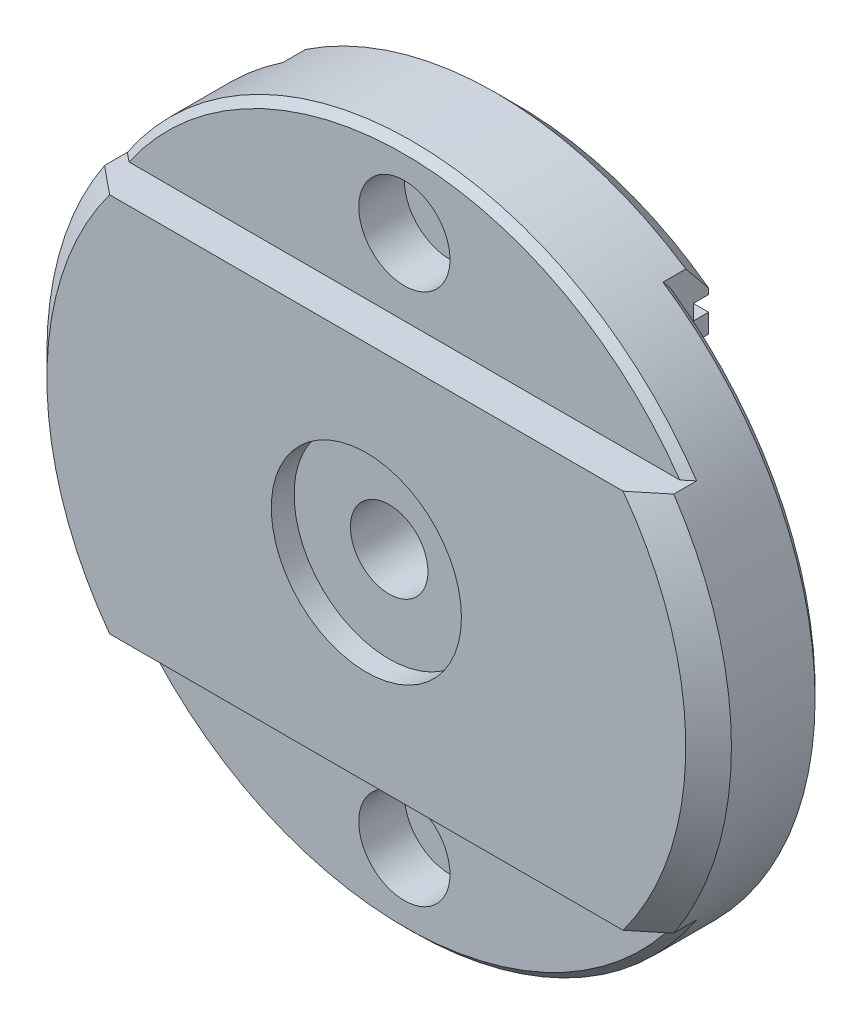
ISO-10303-21;
HEADER;
FILE_DESCRIPTION(('STEP AP214'),'2;1');
FILE_NAME('part.step','',(''),(''),'','','');
FILE_SCHEMA(('AUTOMOTIVE_DESIGN { 1 0 10303 214 1 1 1 1 }'));
ENDSEC;
DATA;
#1=APPLICATION_CONTEXT('core data for automotive mechanical design processes');
#2=APPLICATION_PROTOCOL_DEFINITION('international standard','automotive_design',2000,#1);
#3=PRODUCT_CONTEXT('',#1,'mechanical');
#4=PRODUCT('Part','Part','',(#3));
#5=PRODUCT_RELATED_PRODUCT_CATEGORY('part','',(#4));
#6=PRODUCT_DEFINITION_FORMATION('','',#4);
#7=PRODUCT_DEFINITION_CONTEXT('part definition',#1,'design');
#8=PRODUCT_DEFINITION('design','',#6,#7);
#9=PRODUCT_DEFINITION_SHAPE('','',#8);
#10=(LENGTH_UNIT() NAMED_UNIT(*) SI_UNIT(.MILLI.,.METRE.));
#11=(NAMED_UNIT(*) PLANE_ANGLE_UNIT() SI_UNIT($,.RADIAN.));
#12=(NAMED_UNIT(*) SI_UNIT($,.STERADIAN.) SOLID_ANGLE_UNIT());
#13=UNCERTAINTY_MEASURE_WITH_UNIT(LENGTH_MEASURE(1.E-05),#10,'distance_accuracy_value','');
#14=(GEOMETRIC_REPRESENTATION_CONTEXT(3) GLOBAL_UNCERTAINTY_ASSIGNED_CONTEXT((#13)) GLOBAL_UNIT_ASSIGNED_CONTEXT((#10,
#11,#12)) REPRESENTATION_CONTEXT('',''));
#15=CARTESIAN_POINT('',(0.,0.,0.));
#16=DIRECTION('',(0.,0.,1.));
#17=DIRECTION('',(1.,0.,0.));
#18=AXIS2_PLACEMENT_3D('',#15,#16,#17);
#19=CARTESIAN_POINT('',(0.,0.,-20.));
#20=DIRECTION('',(0.,0.,1.));
#21=DIRECTION('',(1.,0.,0.));
#22=AXIS2_PLACEMENT_3D('',#19,#20,#21);
#23=PLANE('',#22);
#24=CARTESIAN_POINT('',(0.,0.,-20.));
#25=DIRECTION('',(0.,0.,1.));
#26=DIRECTION('',(1.,0.,0.));
#27=AXIS2_PLACEMENT_3D('',#24,#25,#26);
#28=CIRCLE('',#27,5.1);
#29=CARTESIAN_POINT('',(5.1,0.,-20.));
#30=VERTEX_POINT('',#29);
#31=EDGE_CURVE('E765',#30,#30,#28,.T.);
#32=ORIENTED_EDGE('',*,*,#31,.T.);
#33=EDGE_LOOP('',(#32));
#34=FACE_BOUND('',#33,.T.);
#35=DIRECTION('',(-1.,0.,0.));
#36=VECTOR('',#35,1.);
#37=CARTESIAN_POINT('',(25.,-8.50000000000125,-20.));
#38=LINE('',#37,#36);
#39=CARTESIAN_POINT('',(25.,-8.50000000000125,-20.));
#40=VERTEX_POINT('',#39);
#41=CARTESIAN_POINT('',(-25.,-8.50000000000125,-20.));
#42=VERTEX_POINT('',#41);
#43=EDGE_CURVE('E461',#40,#42,#38,.T.);
#44=ORIENTED_EDGE('',*,*,#43,.T.);
#45=DIRECTION('',(0.,-1.,0.));
#46=VECTOR('',#45,1.);
#47=CARTESIAN_POINT('',(-25.,0.,-20.));
#48=LINE('',#47,#46);
#49=CARTESIAN_POINT('',(-25.,8.50000000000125,-20.));
#50=VERTEX_POINT('',#49);
#51=EDGE_CURVE('E1110',#50,#42,#48,.T.);
#52=ORIENTED_EDGE('',*,*,#51,.F.);
#53=DIRECTION('',(-1.,0.,0.));
#54=VECTOR('',#53,1.);
#55=CARTESIAN_POINT('',(25.,8.50000000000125,-20.));
#56=LINE('',#55,#54);
#57=CARTESIAN_POINT('',(25.,8.50000000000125,-20.));
#58=VERTEX_POINT('',#57);
#59=EDGE_CURVE('E603',#58,#50,#56,.T.);
#60=ORIENTED_EDGE('',*,*,#59,.F.);
#61=DIRECTION('',(0.,1.,0.));
#62=VECTOR('',#61,1.);
#63=CARTESIAN_POINT('',(25.,0.,-20.));
#64=LINE('',#63,#62);
#65=EDGE_CURVE('E822',#40,#58,#64,.T.);
#66=ORIENTED_EDGE('',*,*,#65,.F.);
#67=EDGE_LOOP('',(#44,#52,#60,#66));
#68=FACE_BOUND('',#67,.T.);
#69=ADVANCED_FACE('F39',(#34,#68),#23,.F.);
#70=DIRECTION('',(1.,0.,0.));
#71=VECTOR('',#70,1.);
#72=CARTESIAN_POINT('',(25.,-10.5000000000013,-20.));
#73=LINE('',#72,#71);
#74=CARTESIAN_POINT('',(-25.,-10.5000000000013,-20.));
#75=VERTEX_POINT('',#74);
#76=CARTESIAN_POINT('',(25.,-10.5000000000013,-20.));
#77=VERTEX_POINT('',#76);
#78=EDGE_CURVE('E1092',#75,#77,#73,.T.);
#79=ORIENTED_EDGE('',*,*,#78,.T.);
#80=CARTESIAN_POINT('',(25.,-13.0000000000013,-20.));
#81=VERTEX_POINT('',#80);
#82=EDGE_CURVE('E468',#81,#77,#64,.T.);
#83=ORIENTED_EDGE('',*,*,#82,.F.);
#84=DIRECTION('',(-1.,0.,0.));
#85=VECTOR('',#84,1.);
#86=CARTESIAN_POINT('',(25.,-13.0000000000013,-20.));
#87=LINE('',#86,#85);
#88=CARTESIAN_POINT('',(-25.,-13.0000000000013,-20.));
#89=VERTEX_POINT('',#88);
#90=EDGE_CURVE('E479',#81,#89,#87,.T.);
#91=ORIENTED_EDGE('',*,*,#90,.T.);
#92=EDGE_CURVE('E817',#75,#89,#48,.T.);
#93=ORIENTED_EDGE('',*,*,#92,.F.);
#94=EDGE_LOOP('',(#79,#83,#91,#93));
#95=FACE_BOUND('',#94,.T.);
#96=ADVANCED_FACE('F1090',(#95),#23,.F.);
#97=CARTESIAN_POINT('',(-25.,-45.,-15.));
#98=DIRECTION('',(-1.,0.,0.));
#99=DIRECTION('',(0.,0.,1.));
#100=AXIS2_PLACEMENT_3D('',#97,#98,#99);
#101=PLANE('',#100);
#102=CARTESIAN_POINT('',(-25.,-33.0000000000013,-20.));
#103=VERTEX_POINT('',#102);
#104=CARTESIAN_POINT('',(-25.,-33.7490740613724,-20.));
#105=VERTEX_POINT('',#104);
#106=EDGE_CURVE('E812',#103,#105,#48,.T.);
#107=ORIENTED_EDGE('',*,*,#106,.T.);
#108=CARTESIAN_POINT('',(-25.,-33.7490740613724,-20.));
#109=CARTESIAN_POINT('',(-25.,-34.0568724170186,-19.7526668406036));
#110=CARTESIAN_POINT('',(-25.,-34.3640869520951,-19.504607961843));
#111=CARTESIAN_POINT('',(-25.,-34.9774056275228,-19.0071320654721));
#112=CARTESIAN_POINT('',(-25.,-35.2835097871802,-18.7577150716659));
#113=CARTESIAN_POINT('',(-25.,-35.8946751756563,-18.2576080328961));
#114=CARTESIAN_POINT('',(-25.,-36.1997364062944,-18.0069179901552));
#115=CARTESIAN_POINT('',(-25.,-36.8088780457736,-17.5043381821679));
#116=CARTESIAN_POINT('',(-25.,-37.1129584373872,-17.2524483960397));
#117=CARTESIAN_POINT('',(-25.,-37.4165738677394,-17.));
#118=B_SPLINE_CURVE_WITH_KNOTS('',3,(#108,#109,#110,#111,#112,#113,#114,#115,#116,#117),
.UNSPECIFIED.,.F.,.F.,(4,2,2,2,4),(0.,1.1845747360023,2.36912877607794,3.55368074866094,
4.73825341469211),.UNSPECIFIED.);
#119=CARTESIAN_POINT('',(-25.,-37.4165738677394,-17.));
#120=VERTEX_POINT('',#119);
#121=EDGE_CURVE('E48',#105,#120,#118,.T.);
#122=ORIENTED_EDGE('',*,*,#121,.T.);
#123=DIRECTION('',(0.,0.,1.));
#124=VECTOR('',#123,1.);
#125=CARTESIAN_POINT('',(-25.,-37.4165738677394,-20.));
#126=LINE('',#125,#124);
#127=CARTESIAN_POINT('',(-25.,-37.4165738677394,-14.));
#128=VERTEX_POINT('',#127);
#129=EDGE_CURVE('E782',#128,#120,#126,.F.);
#130=ORIENTED_EDGE('',*,*,#129,.F.);
#131=CARTESIAN_POINT('',(-25.,-37.4165738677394,-14.));
#132=CARTESIAN_POINT('',(-25.,-37.2155248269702,-14.1671795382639));
#133=CARTESIAN_POINT('',(-25.,-37.0142636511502,-14.334102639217));
#134=CARTESIAN_POINT('',(-25.,-36.6113170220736,-14.667435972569));
#135=CARTESIAN_POINT('',(-25.,-36.4096315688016,-14.8338462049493));
#136=CARTESIAN_POINT('',(-25.,-36.2077339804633,-15.));
#137=B_SPLINE_CURVE_WITH_KNOTS('',3,(#131,#132,#133,#134,#135,#136),.UNSPECIFIED.,.F.,.F.,(4,2,
4),(0.,0.784426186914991,1.56885240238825),.UNSPECIFIED.);
#138=CARTESIAN_POINT('',(-25.,-36.2077339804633,-15.));
#139=VERTEX_POINT('',#138);
#140=EDGE_CURVE('E1018',#128,#139,#137,.T.);
#141=ORIENTED_EDGE('',*,*,#140,.T.);
#142=DIRECTION('',(0.,1.,0.));
#143=VECTOR('',#142,1.);
#144=CARTESIAN_POINT('',(-25.,-45.,-15.));
#145=LINE('',#144,#143);
#146=CARTESIAN_POINT('',(-25.,36.2077339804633,-15.));
#147=VERTEX_POINT('',#146);
#148=EDGE_CURVE('E777',#139,#147,#145,.T.);
#149=ORIENTED_EDGE('',*,*,#148,.T.);
#150=CARTESIAN_POINT('',(-25.,36.2077339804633,-15.));
#151=CARTESIAN_POINT('',(-25.,36.4096315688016,-14.8338462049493));
#152=CARTESIAN_POINT('',(-25.,36.6113170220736,-14.667435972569));
#153=CARTESIAN_POINT('',(-25.,37.0142636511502,-14.334102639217));
#154=CARTESIAN_POINT('',(-25.,37.2155248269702,-14.1671795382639));
#155=CARTESIAN_POINT('',(-25.,37.4165738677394,-14.));
#156=B_SPLINE_CURVE_WITH_KNOTS('',3,(#150,#151,#152,#153,#154,#155),.UNSPECIFIED.,.F.,.F.,(4,2,
4),(0.,0.784426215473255,1.56885240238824),.UNSPECIFIED.);
#157=CARTESIAN_POINT('',(-25.,37.4165738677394,-14.));
#158=VERTEX_POINT('',#157);
#159=EDGE_CURVE('E1016',#147,#158,#156,.T.);
#160=ORIENTED_EDGE('',*,*,#159,.T.);
#161=DIRECTION('',(0.,0.,1.));
#162=VECTOR('',#161,1.);
#163=CARTESIAN_POINT('',(-25.,37.4165738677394,-20.));
#164=LINE('',#163,#162);
#165=CARTESIAN_POINT('',(-25.,37.4165738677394,-17.));
#166=VERTEX_POINT('',#165);
#167=EDGE_CURVE('E780',#166,#158,#164,.T.);
#168=ORIENTED_EDGE('',*,*,#167,.F.);
#169=CARTESIAN_POINT('',(-25.,37.4165738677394,-17.));
#170=CARTESIAN_POINT('',(-25.,37.1129584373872,-17.2524483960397));
#171=CARTESIAN_POINT('',(-25.,36.8088780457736,-17.5043381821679));
#172=CARTESIAN_POINT('',(-25.,36.1997364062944,-18.0069179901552));
#173=CARTESIAN_POINT('',(-25.,35.8946751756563,-18.2576080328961));
#174=CARTESIAN_POINT('',(-25.,35.2835097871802,-18.7577150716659));
#175=CARTESIAN_POINT('',(-25.,34.9774056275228,-19.0071320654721));
#176=CARTESIAN_POINT('',(-25.,34.3640869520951,-19.504607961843));
#177=CARTESIAN_POINT('',(-25.,34.0568724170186,-19.7526668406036));
#178=CARTESIAN_POINT('',(-25.,33.7490740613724,-20.));
#179=B_SPLINE_CURVE_WITH_KNOTS('',3,(#169,#170,#171,#172,#173,#174,#175,#176,#177,#178),
.UNSPECIFIED.,.F.,.F.,(4,2,2,2,4),(0.,1.18457266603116,2.36912463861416,3.5536786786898,
4.7382534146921),.UNSPECIFIED.);
#180=CARTESIAN_POINT('',(-25.,33.7490740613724,-20.));
#181=VERTEX_POINT('',#180);
#182=EDGE_CURVE('E55',#166,#181,#179,.T.);
#183=ORIENTED_EDGE('',*,*,#182,.T.);
#184=CARTESIAN_POINT('',(-25.,33.0000000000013,-20.));
#185=VERTEX_POINT('',#184);
#186=EDGE_CURVE('E813',#181,#185,#48,.T.);
#187=ORIENTED_EDGE('',*,*,#186,.T.);
#188=DIRECTION('',(0.,0.,-1.));
#189=VECTOR('',#188,1.);
#190=CARTESIAN_POINT('',(-25.,33.0000000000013,-18.));
#191=LINE('',#190,#189);
#192=CARTESIAN_POINT('',(-25.,33.0000000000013,-18.));
#193=VERTEX_POINT('',#192);
#194=EDGE_CURVE('E755',#193,#185,#191,.T.);
#195=ORIENTED_EDGE('',*,*,#194,.F.);
#196=DIRECTION('',(0.,1.,0.));
#197=VECTOR('',#196,1.);
#198=CARTESIAN_POINT('',(-25.,33.0000000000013,-18.));
#199=LINE('',#198,#197);
#200=CARTESIAN_POINT('',(-25.,31.0000000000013,-18.));
#201=VERTEX_POINT('',#200);
#202=EDGE_CURVE('E744',#201,#193,#199,.T.);
#203=ORIENTED_EDGE('',*,*,#202,.F.);
#204=DIRECTION('',(0.,0.,-1.));
#205=VECTOR('',#204,1.);
#206=CARTESIAN_POINT('',(-25.,31.0000000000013,-18.));
#207=LINE('',#206,#205);
#208=CARTESIAN_POINT('',(-25.,31.0000000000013,-20.));
#209=VERTEX_POINT('',#208);
#210=EDGE_CURVE('E758',#201,#209,#207,.T.);
#211=ORIENTED_EDGE('',*,*,#210,.T.);
#212=CARTESIAN_POINT('',(-25.,28.5000000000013,-20.));
#213=VERTEX_POINT('',#212);
#214=EDGE_CURVE('E816',#209,#213,#48,.T.);
#215=ORIENTED_EDGE('',*,*,#214,.T.);
#216=DIRECTION('',(0.,0.,-1.));
#217=VECTOR('',#216,1.);
#218=CARTESIAN_POINT('',(-25.,28.5000000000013,-18.));
#219=LINE('',#218,#217);
#220=CARTESIAN_POINT('',(-25.,28.5000000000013,-18.));
#221=VERTEX_POINT('',#220);
#222=EDGE_CURVE('E730',#221,#213,#219,.T.);
#223=ORIENTED_EDGE('',*,*,#222,.F.);
#224=DIRECTION('',(0.,1.,0.));
#225=VECTOR('',#224,1.);
#226=CARTESIAN_POINT('',(-25.,28.5000000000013,-18.));
#227=LINE('',#226,#225);
#228=CARTESIAN_POINT('',(-25.,26.5000000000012,-18.));
#229=VERTEX_POINT('',#228);
#230=EDGE_CURVE('E719',#229,#221,#227,.T.);
#231=ORIENTED_EDGE('',*,*,#230,.F.);
#232=DIRECTION('',(0.,0.,-1.));
#233=VECTOR('',#232,1.);
#234=CARTESIAN_POINT('',(-25.,26.5000000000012,-18.));
#235=LINE('',#234,#233);
#236=CARTESIAN_POINT('',(-25.,26.5000000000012,-20.));
#237=VERTEX_POINT('',#236);
#238=EDGE_CURVE('E732',#229,#237,#235,.T.);
#239=ORIENTED_EDGE('',*,*,#238,.T.);
#240=CARTESIAN_POINT('',(-25.,24.0000000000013,-20.));
#241=VERTEX_POINT('',#240);
#242=EDGE_CURVE('E1886',#237,#241,#48,.T.);
#243=ORIENTED_EDGE('',*,*,#242,.T.);
#244=DIRECTION('',(0.,0.,-1.));
#245=VECTOR('',#244,1.);
#246=CARTESIAN_POINT('',(-25.,24.0000000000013,-18.));
#247=LINE('',#246,#245);
#248=CARTESIAN_POINT('',(-25.,24.0000000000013,-18.));
#249=VERTEX_POINT('',#248);
#250=EDGE_CURVE('E705',#249,#241,#247,.T.);
#251=ORIENTED_EDGE('',*,*,#250,.F.);
#252=DIRECTION('',(0.,1.,0.));
#253=VECTOR('',#252,1.);
#254=CARTESIAN_POINT('',(-25.,24.0000000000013,-18.));
#255=LINE('',#254,#253);
#256=CARTESIAN_POINT('',(-25.,22.0000000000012,-18.));
#257=VERTEX_POINT('',#256);
#258=EDGE_CURVE('E694',#257,#249,#255,.T.);
#259=ORIENTED_EDGE('',*,*,#258,.F.);
#260=DIRECTION('',(0.,0.,-1.));
#261=VECTOR('',#260,1.);
#262=CARTESIAN_POINT('',(-25.,22.0000000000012,-18.));
#263=LINE('',#262,#261);
#264=CARTESIAN_POINT('',(-25.,22.0000000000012,-20.));
#265=VERTEX_POINT('',#264);
#266=EDGE_CURVE('E707',#257,#265,#263,.T.);
#267=ORIENTED_EDGE('',*,*,#266,.T.);
#268=CARTESIAN_POINT('',(-25.,19.5000000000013,-20.));
#269=VERTEX_POINT('',#268);
#270=EDGE_CURVE('E1876',#265,#269,#48,.T.);
#271=ORIENTED_EDGE('',*,*,#270,.T.);
#272=DIRECTION('',(0.,0.,-1.));
#273=VECTOR('',#272,1.);
#274=CARTESIAN_POINT('',(-25.,19.5000000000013,-18.));
#275=LINE('',#274,#273);
#276=CARTESIAN_POINT('',(-25.,19.5000000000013,-18.));
#277=VERTEX_POINT('',#276);
#278=EDGE_CURVE('E680',#277,#269,#275,.T.);
#279=ORIENTED_EDGE('',*,*,#278,.F.);
#280=DIRECTION('',(0.,1.,0.));
#281=VECTOR('',#280,1.);
#282=CARTESIAN_POINT('',(-25.,19.5000000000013,-18.));
#283=LINE('',#282,#281);
#284=CARTESIAN_POINT('',(-25.,17.5000000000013,-18.));
#285=VERTEX_POINT('',#284);
#286=EDGE_CURVE('E669',#285,#277,#283,.T.);
#287=ORIENTED_EDGE('',*,*,#286,.F.);
#288=DIRECTION('',(0.,0.,-1.));
#289=VECTOR('',#288,1.);
#290=CARTESIAN_POINT('',(-25.,17.5000000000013,-18.));
#291=LINE('',#290,#289);
#292=CARTESIAN_POINT('',(-25.,17.5000000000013,-20.));
#293=VERTEX_POINT('',#292);
#294=EDGE_CURVE('E682',#285,#293,#291,.T.);
#295=ORIENTED_EDGE('',*,*,#294,.T.);
#296=CARTESIAN_POINT('',(-25.,15.0000000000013,-20.));
#297=VERTEX_POINT('',#296);
#298=EDGE_CURVE('E1114',#293,#297,#48,.T.);
#299=ORIENTED_EDGE('',*,*,#298,.T.);
#300=DIRECTION('',(0.,0.,-1.));
#301=VECTOR('',#300,1.);
#302=CARTESIAN_POINT('',(-25.,15.0000000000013,-18.));
#303=LINE('',#302,#301);
#304=CARTESIAN_POINT('',(-25.,15.0000000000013,-18.));
#305=VERTEX_POINT('',#304);
#306=EDGE_CURVE('E655',#305,#297,#303,.T.);
#307=ORIENTED_EDGE('',*,*,#306,.F.);
#308=DIRECTION('',(0.,1.,0.));
#309=VECTOR('',#308,1.);
#310=CARTESIAN_POINT('',(-25.,15.0000000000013,-18.));
#311=LINE('',#310,#309);
#312=CARTESIAN_POINT('',(-25.,13.0000000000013,-18.));
#313=VERTEX_POINT('',#312);
#314=EDGE_CURVE('E644',#313,#305,#311,.T.);
#315=ORIENTED_EDGE('',*,*,#314,.F.);
#316=DIRECTION('',(0.,0.,-1.));
#317=VECTOR('',#316,1.);
#318=CARTESIAN_POINT('',(-25.,13.0000000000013,-18.));
#319=LINE('',#318,#317);
#320=CARTESIAN_POINT('',(-25.,13.0000000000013,-20.));
#321=VERTEX_POINT('',#320);
#322=EDGE_CURVE('E657',#313,#321,#319,.T.);
#323=ORIENTED_EDGE('',*,*,#322,.T.);
#324=CARTESIAN_POINT('',(-25.,10.5000000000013,-20.));
#325=VERTEX_POINT('',#324);
#326=EDGE_CURVE('E1112',#321,#325,#48,.T.);
#327=ORIENTED_EDGE('',*,*,#326,.T.);
#328=DIRECTION('',(0.,0.,-1.));
#329=VECTOR('',#328,1.);
#330=CARTESIAN_POINT('',(-25.,10.5000000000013,-18.));
#331=LINE('',#330,#329);
#332=CARTESIAN_POINT('',(-25.,10.5000000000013,-18.));
#333=VERTEX_POINT('',#332);
#334=EDGE_CURVE('E630',#333,#325,#331,.T.);
#335=ORIENTED_EDGE('',*,*,#334,.F.);
#336=DIRECTION('',(0.,1.,0.));
#337=VECTOR('',#336,1.);
#338=CARTESIAN_POINT('',(-25.,10.5000000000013,-18.));
#339=LINE('',#338,#337);
#340=CARTESIAN_POINT('',(-25.,8.50000000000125,-18.));
#341=VERTEX_POINT('',#340);
#342=EDGE_CURVE('E619',#341,#333,#339,.T.);
#343=ORIENTED_EDGE('',*,*,#342,.F.);
#344=DIRECTION('',(0.,0.,-1.));
#345=VECTOR('',#344,1.);
#346=CARTESIAN_POINT('',(-25.,8.50000000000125,-18.));
#347=LINE('',#346,#345);
#348=EDGE_CURVE('E632',#341,#50,#347,.T.);
#349=ORIENTED_EDGE('',*,*,#348,.T.);
#350=ORIENTED_EDGE('',*,*,#51,.T.);
#351=DIRECTION('',(0.,0.,-1.));
#352=VECTOR('',#351,1.);
#353=CARTESIAN_POINT('',(-25.,-8.50000000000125,-18.));
#354=LINE('',#353,#352);
#355=CARTESIAN_POINT('',(-25.,-8.50000000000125,-18.));
#356=VERTEX_POINT('',#355);
#357=EDGE_CURVE('E470',#356,#42,#354,.T.);
#358=ORIENTED_EDGE('',*,*,#357,.F.);
#359=DIRECTION('',(0.,-1.,0.));
#360=VECTOR('',#359,1.);
#361=CARTESIAN_POINT('',(-25.,-10.5000000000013,-18.));
#362=LINE('',#361,#360);
#363=CARTESIAN_POINT('',(-25.,-10.5000000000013,-18.));
#364=VERTEX_POINT('',#363);
#365=EDGE_CURVE('E452',#356,#364,#362,.T.);
#366=ORIENTED_EDGE('',*,*,#365,.T.);
#367=DIRECTION('',(0.,0.,-1.));
#368=VECTOR('',#367,1.);
#369=CARTESIAN_POINT('',(-25.,-10.5000000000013,-18.));
#370=LINE('',#369,#368);
#371=EDGE_CURVE('E448',#364,#75,#370,.T.);
#372=ORIENTED_EDGE('',*,*,#371,.T.);
#373=ORIENTED_EDGE('',*,*,#92,.T.);
#374=DIRECTION('',(0.,0.,-1.));
#375=VECTOR('',#374,1.);
#376=CARTESIAN_POINT('',(-25.,-13.0000000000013,-18.));
#377=LINE('',#376,#375);
#378=CARTESIAN_POINT('',(-25.,-13.0000000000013,-18.));
#379=VERTEX_POINT('',#378);
#380=EDGE_CURVE('E496',#379,#89,#377,.T.);
#381=ORIENTED_EDGE('',*,*,#380,.F.);
#382=DIRECTION('',(0.,-1.,0.));
#383=VECTOR('',#382,1.);
#384=CARTESIAN_POINT('',(-25.,-15.0000000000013,-18.));
#385=LINE('',#384,#383);
#386=CARTESIAN_POINT('',(-25.,-15.0000000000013,-18.));
#387=VERTEX_POINT('',#386);
#388=EDGE_CURVE('E481',#379,#387,#385,.T.);
#389=ORIENTED_EDGE('',*,*,#388,.T.);
#390=DIRECTION('',(0.,0.,-1.));
#391=VECTOR('',#390,1.);
#392=CARTESIAN_POINT('',(-25.,-15.0000000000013,-18.));
#393=LINE('',#392,#391);
#394=CARTESIAN_POINT('',(-25.,-15.0000000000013,-20.));
#395=VERTEX_POINT('',#394);
#396=EDGE_CURVE('E499',#387,#395,#393,.T.);
#397=ORIENTED_EDGE('',*,*,#396,.T.);
#398=CARTESIAN_POINT('',(-25.,-17.5000000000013,-20.));
#399=VERTEX_POINT('',#398);
#400=EDGE_CURVE('E1077',#395,#399,#48,.T.);
#401=ORIENTED_EDGE('',*,*,#400,.T.);
#402=DIRECTION('',(0.,0.,-1.));
#403=VECTOR('',#402,1.);
#404=CARTESIAN_POINT('',(-25.,-17.5000000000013,-18.));
#405=LINE('',#404,#403);
#406=CARTESIAN_POINT('',(-25.,-17.5000000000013,-18.));
#407=VERTEX_POINT('',#406);
#408=EDGE_CURVE('E523',#407,#399,#405,.T.);
#409=ORIENTED_EDGE('',*,*,#408,.F.);
#410=DIRECTION('',(0.,-1.,0.));
#411=VECTOR('',#410,1.);
#412=CARTESIAN_POINT('',(-25.,-19.5000000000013,-18.));
#413=LINE('',#412,#411);
#414=CARTESIAN_POINT('',(-25.,-19.5000000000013,-18.));
#415=VERTEX_POINT('',#414);
#416=EDGE_CURVE('E509',#407,#415,#413,.T.);
#417=ORIENTED_EDGE('',*,*,#416,.T.);
#418=DIRECTION('',(0.,0.,-1.));
#419=VECTOR('',#418,1.);
#420=CARTESIAN_POINT('',(-25.,-19.5000000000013,-18.));
#421=LINE('',#420,#419);
#422=CARTESIAN_POINT('',(-25.,-19.5000000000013,-20.));
#423=VERTEX_POINT('',#422);
#424=EDGE_CURVE('E526',#415,#423,#421,.T.);
#425=ORIENTED_EDGE('',*,*,#424,.T.);
#426=CARTESIAN_POINT('',(-25.,-22.0000000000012,-20.));
#427=VERTEX_POINT('',#426);
#428=EDGE_CURVE('E1119',#423,#427,#48,.T.);
#429=ORIENTED_EDGE('',*,*,#428,.T.);
#430=DIRECTION('',(0.,0.,-1.));
#431=VECTOR('',#430,1.);
#432=CARTESIAN_POINT('',(-25.,-22.0000000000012,-18.));
#433=LINE('',#432,#431);
#434=CARTESIAN_POINT('',(-25.,-22.0000000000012,-18.));
#435=VERTEX_POINT('',#434);
#436=EDGE_CURVE('E550',#435,#427,#433,.T.);
#437=ORIENTED_EDGE('',*,*,#436,.F.);
#438=DIRECTION('',(0.,-1.,0.));
#439=VECTOR('',#438,1.);
#440=CARTESIAN_POINT('',(-25.,-24.0000000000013,-18.));
#441=LINE('',#440,#439);
#442=CARTESIAN_POINT('',(-25.,-24.0000000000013,-18.));
#443=VERTEX_POINT('',#442);
#444=EDGE_CURVE('E536',#435,#443,#441,.T.);
#445=ORIENTED_EDGE('',*,*,#444,.T.);
#446=DIRECTION('',(0.,0.,-1.));
#447=VECTOR('',#446,1.);
#448=CARTESIAN_POINT('',(-25.,-24.0000000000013,-18.));
#449=LINE('',#448,#447);
#450=CARTESIAN_POINT('',(-25.,-24.0000000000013,-20.));
#451=VERTEX_POINT('',#450);
#452=EDGE_CURVE('E553',#443,#451,#449,.T.);
#453=ORIENTED_EDGE('',*,*,#452,.T.);
#454=CARTESIAN_POINT('',(-25.,-26.5000000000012,-20.));
#455=VERTEX_POINT('',#454);
#456=EDGE_CURVE('E1116',#451,#455,#48,.T.);
#457=ORIENTED_EDGE('',*,*,#456,.T.);
#458=DIRECTION('',(0.,0.,-1.));
#459=VECTOR('',#458,1.);
#460=CARTESIAN_POINT('',(-25.,-26.5000000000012,-18.));
#461=LINE('',#460,#459);
#462=CARTESIAN_POINT('',(-25.,-26.5000000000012,-18.));
#463=VERTEX_POINT('',#462);
#464=EDGE_CURVE('E577',#463,#455,#461,.T.);
#465=ORIENTED_EDGE('',*,*,#464,.F.);
#466=DIRECTION('',(0.,-1.,0.));
#467=VECTOR('',#466,1.);
#468=CARTESIAN_POINT('',(-25.,-28.5000000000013,-18.));
#469=LINE('',#468,#467);
#470=CARTESIAN_POINT('',(-25.,-28.5000000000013,-18.));
#471=VERTEX_POINT('',#470);
#472=EDGE_CURVE('E563',#463,#471,#469,.T.);
#473=ORIENTED_EDGE('',*,*,#472,.T.);
#474=DIRECTION('',(0.,0.,-1.));
#475=VECTOR('',#474,1.);
#476=CARTESIAN_POINT('',(-25.,-28.5000000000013,-18.));
#477=LINE('',#476,#475);
#478=CARTESIAN_POINT('',(-25.,-28.5000000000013,-20.));
#479=VERTEX_POINT('',#478);
#480=EDGE_CURVE('E580',#471,#479,#477,.T.);
#481=ORIENTED_EDGE('',*,*,#480,.T.);
#482=CARTESIAN_POINT('',(-25.,-31.0000000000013,-20.));
#483=VERTEX_POINT('',#482);
#484=EDGE_CURVE('E1115',#479,#483,#48,.T.);
#485=ORIENTED_EDGE('',*,*,#484,.T.);
#486=DIRECTION('',(0.,0.,-1.));
#487=VECTOR('',#486,1.);
#488=CARTESIAN_POINT('',(-25.,-31.0000000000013,-18.));
#489=LINE('',#488,#487);
#490=CARTESIAN_POINT('',(-25.,-31.0000000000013,-18.));
#491=VERTEX_POINT('',#490);
#492=EDGE_CURVE('E604',#491,#483,#489,.T.);
#493=ORIENTED_EDGE('',*,*,#492,.F.);
#494=DIRECTION('',(0.,-1.,0.));
#495=VECTOR('',#494,1.);
#496=CARTESIAN_POINT('',(-25.,-33.0000000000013,-18.));
#497=LINE('',#496,#495);
#498=CARTESIAN_POINT('',(-25.,-33.0000000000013,-18.));
#499=VERTEX_POINT('',#498);
#500=EDGE_CURVE('E590',#491,#499,#497,.T.);
#501=ORIENTED_EDGE('',*,*,#500,.T.);
#502=DIRECTION('',(0.,0.,-1.));
#503=VECTOR('',#502,1.);
#504=CARTESIAN_POINT('',(-25.,-33.0000000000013,-18.));
#505=LINE('',#504,#503);
#506=EDGE_CURVE('E607',#499,#103,#505,.T.);
#507=ORIENTED_EDGE('',*,*,#506,.T.);
#508=EDGE_LOOP('',(#107,#122,#130,#141,#149,#160,#168,#183,#187,#195,#203,#211,#215,#223,#231,
#239,#243,#251,#259,#267,#271,#279,#287,#295,#299,#307,#315,#323,#327,#335,#343,#349,#350,#358,
#366,#372,#373,#381,#389,#397,#401,#409,#417,#425,#429,#437,#445,#453,#457,#465,#473,#481,#485,
#493,#501,#507));
#509=FACE_BOUND('',#508,.T.);
#510=ADVANCED_FACE('F863',(#509),#101,.T.);
#511=CARTESIAN_POINT('',(25.,-45.,-15.));
#512=DIRECTION('',(1.,0.,0.));
#513=DIRECTION('',(0.,0.,-1.));
#514=AXIS2_PLACEMENT_3D('',#511,#512,#513);
#515=PLANE('',#514);
#516=DIRECTION('',(0.,0.,1.));
#517=VECTOR('',#516,1.);
#518=CARTESIAN_POINT('',(25.,-37.4165738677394,-20.));
#519=LINE('',#518,#517);
#520=CARTESIAN_POINT('',(25.,-37.4165738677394,-17.));
#521=VERTEX_POINT('',#520);
#522=CARTESIAN_POINT('',(25.,-37.4165738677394,-14.));
#523=VERTEX_POINT('',#522);
#524=EDGE_CURVE('E785',#521,#523,#519,.T.);
#525=ORIENTED_EDGE('',*,*,#524,.F.);
#526=CARTESIAN_POINT('',(25.,-37.4165738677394,-17.));
#527=CARTESIAN_POINT('',(25.,-37.1129584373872,-17.2524483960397));
#528=CARTESIAN_POINT('',(25.,-36.8088780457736,-17.5043381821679));
#529=CARTESIAN_POINT('',(25.,-36.1997364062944,-18.0069179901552));
#530=CARTESIAN_POINT('',(25.,-35.8946751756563,-18.2576080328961));
#531=CARTESIAN_POINT('',(25.,-35.2835097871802,-18.7577150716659));
#532=CARTESIAN_POINT('',(25.,-34.9774056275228,-19.0071320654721));
#533=CARTESIAN_POINT('',(25.,-34.3640869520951,-19.504607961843));
#534=CARTESIAN_POINT('',(25.,-34.0568724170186,-19.7526668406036));
#535=CARTESIAN_POINT('',(25.,-33.7490740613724,-20.));
#536=B_SPLINE_CURVE_WITH_KNOTS('',3,(#526,#527,#528,#529,#530,#531,#532,#533,#534,#535),
.UNSPECIFIED.,.F.,.F.,(4,2,2,2,4),(0.,1.18457266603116,2.36912463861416,3.5536786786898,
4.7382534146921),.UNSPECIFIED.);
#537=CARTESIAN_POINT('',(25.,-33.7490740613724,-20.));
#538=VERTEX_POINT('',#537);
#539=EDGE_CURVE('E878',#521,#538,#536,.T.);
#540=ORIENTED_EDGE('',*,*,#539,.T.);
#541=CARTESIAN_POINT('',(25.,-33.0000000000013,-20.));
#542=VERTEX_POINT('',#541);
#543=EDGE_CURVE('E818',#538,#542,#64,.T.);
#544=ORIENTED_EDGE('',*,*,#543,.T.);
#545=DIRECTION('',(0.,0.,-1.));
#546=VECTOR('',#545,1.);
#547=CARTESIAN_POINT('',(25.,-33.0000000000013,-18.));
#548=LINE('',#547,#546);
#549=CARTESIAN_POINT('',(25.,-33.0000000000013,-18.));
#550=VERTEX_POINT('',#549);
#551=EDGE_CURVE('E595',#550,#542,#548,.T.);
#552=ORIENTED_EDGE('',*,*,#551,.F.);
#553=DIRECTION('',(0.,1.,0.));
#554=VECTOR('',#553,1.);
#555=CARTESIAN_POINT('',(25.,-33.0000000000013,-18.));
#556=LINE('',#555,#554);
#557=CARTESIAN_POINT('',(25.,-31.0000000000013,-18.));
#558=VERTEX_POINT('',#557);
#559=EDGE_CURVE('E584',#550,#558,#556,.T.);
#560=ORIENTED_EDGE('',*,*,#559,.T.);
#561=DIRECTION('',(0.,0.,-1.));
#562=VECTOR('',#561,1.);
#563=CARTESIAN_POINT('',(25.,-31.0000000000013,-18.));
#564=LINE('',#563,#562);
#565=CARTESIAN_POINT('',(25.,-31.0000000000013,-20.));
#566=VERTEX_POINT('',#565);
#567=EDGE_CURVE('E600',#558,#566,#564,.T.);
#568=ORIENTED_EDGE('',*,*,#567,.T.);
#569=CARTESIAN_POINT('',(25.,-28.5000000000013,-20.));
#570=VERTEX_POINT('',#569);
#571=EDGE_CURVE('E821',#566,#570,#64,.T.);
#572=ORIENTED_EDGE('',*,*,#571,.T.);
#573=DIRECTION('',(0.,0.,-1.));
#574=VECTOR('',#573,1.);
#575=CARTESIAN_POINT('',(25.,-28.5000000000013,-18.));
#576=LINE('',#575,#574);
#577=CARTESIAN_POINT('',(25.,-28.5000000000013,-18.));
#578=VERTEX_POINT('',#577);
#579=EDGE_CURVE('E568',#578,#570,#576,.T.);
#580=ORIENTED_EDGE('',*,*,#579,.F.);
#581=DIRECTION('',(0.,1.,0.));
#582=VECTOR('',#581,1.);
#583=CARTESIAN_POINT('',(25.,-28.5000000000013,-18.));
#584=LINE('',#583,#582);
#585=CARTESIAN_POINT('',(25.,-26.5000000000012,-18.));
#586=VERTEX_POINT('',#585);
#587=EDGE_CURVE('E557',#578,#586,#584,.T.);
#588=ORIENTED_EDGE('',*,*,#587,.T.);
#589=DIRECTION('',(0.,0.,-1.));
#590=VECTOR('',#589,1.);
#591=CARTESIAN_POINT('',(25.,-26.5000000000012,-18.));
#592=LINE('',#591,#590);
#593=CARTESIAN_POINT('',(25.,-26.5000000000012,-20.));
#594=VERTEX_POINT('',#593);
#595=EDGE_CURVE('E573',#586,#594,#592,.T.);
#596=ORIENTED_EDGE('',*,*,#595,.T.);
#597=CARTESIAN_POINT('',(25.,-24.0000000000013,-20.));
#598=VERTEX_POINT('',#597);
#599=EDGE_CURVE('E1061',#594,#598,#64,.T.);
#600=ORIENTED_EDGE('',*,*,#599,.T.);
#601=DIRECTION('',(0.,0.,-1.));
#602=VECTOR('',#601,1.);
#603=CARTESIAN_POINT('',(25.,-24.0000000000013,-18.));
#604=LINE('',#603,#602);
#605=CARTESIAN_POINT('',(25.,-24.0000000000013,-18.));
#606=VERTEX_POINT('',#605);
#607=EDGE_CURVE('E541',#606,#598,#604,.T.);
#608=ORIENTED_EDGE('',*,*,#607,.F.);
#609=DIRECTION('',(0.,1.,0.));
#610=VECTOR('',#609,1.);
#611=CARTESIAN_POINT('',(25.,-24.0000000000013,-18.));
#612=LINE('',#611,#610);
#613=CARTESIAN_POINT('',(25.,-22.0000000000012,-18.));
#614=VERTEX_POINT('',#613);
#615=EDGE_CURVE('E530',#606,#614,#612,.T.);
#616=ORIENTED_EDGE('',*,*,#615,.T.);
#617=DIRECTION('',(0.,0.,-1.));
#618=VECTOR('',#617,1.);
#619=CARTESIAN_POINT('',(25.,-22.0000000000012,-18.));
#620=LINE('',#619,#618);
#621=CARTESIAN_POINT('',(25.,-22.0000000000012,-20.));
#622=VERTEX_POINT('',#621);
#623=EDGE_CURVE('E546',#614,#622,#620,.T.);
#624=ORIENTED_EDGE('',*,*,#623,.T.);
#625=CARTESIAN_POINT('',(25.,-19.5000000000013,-20.));
#626=VERTEX_POINT('',#625);
#627=EDGE_CURVE('E1065',#622,#626,#64,.T.);
#628=ORIENTED_EDGE('',*,*,#627,.T.);
#629=DIRECTION('',(0.,0.,-1.));
#630=VECTOR('',#629,1.);
#631=CARTESIAN_POINT('',(25.,-19.5000000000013,-18.));
#632=LINE('',#631,#630);
#633=CARTESIAN_POINT('',(25.,-19.5000000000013,-18.));
#634=VERTEX_POINT('',#633);
#635=EDGE_CURVE('E514',#634,#626,#632,.T.);
#636=ORIENTED_EDGE('',*,*,#635,.F.);
#637=DIRECTION('',(0.,1.,0.));
#638=VECTOR('',#637,1.);
#639=CARTESIAN_POINT('',(25.,-19.5000000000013,-18.));
#640=LINE('',#639,#638);
#641=CARTESIAN_POINT('',(25.,-17.5000000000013,-18.));
#642=VERTEX_POINT('',#641);
#643=EDGE_CURVE('E503',#634,#642,#640,.T.);
#644=ORIENTED_EDGE('',*,*,#643,.T.);
#645=DIRECTION('',(0.,0.,-1.));
#646=VECTOR('',#645,1.);
#647=CARTESIAN_POINT('',(25.,-17.5000000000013,-18.));
#648=LINE('',#647,#646);
#649=CARTESIAN_POINT('',(25.,-17.5000000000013,-20.));
#650=VERTEX_POINT('',#649);
#651=EDGE_CURVE('E519',#642,#650,#648,.T.);
#652=ORIENTED_EDGE('',*,*,#651,.T.);
#653=CARTESIAN_POINT('',(25.,-15.0000000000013,-20.));
#654=VERTEX_POINT('',#653);
#655=EDGE_CURVE('E1069',#650,#654,#64,.T.);
#656=ORIENTED_EDGE('',*,*,#655,.T.);
#657=DIRECTION('',(0.,0.,-1.));
#658=VECTOR('',#657,1.);
#659=CARTESIAN_POINT('',(25.,-15.0000000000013,-18.));
#660=LINE('',#659,#658);
#661=CARTESIAN_POINT('',(25.,-15.0000000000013,-18.));
#662=VERTEX_POINT('',#661);
#663=EDGE_CURVE('E486',#662,#654,#660,.T.);
#664=ORIENTED_EDGE('',*,*,#663,.F.);
#665=DIRECTION('',(0.,1.,0.));
#666=VECTOR('',#665,1.);
#667=CARTESIAN_POINT('',(25.,-15.0000000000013,-18.));
#668=LINE('',#667,#666);
#669=CARTESIAN_POINT('',(25.,-13.0000000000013,-18.));
#670=VERTEX_POINT('',#669);
#671=EDGE_CURVE('E475',#662,#670,#668,.T.);
#672=ORIENTED_EDGE('',*,*,#671,.T.);
#673=DIRECTION('',(0.,0.,-1.));
#674=VECTOR('',#673,1.);
#675=CARTESIAN_POINT('',(25.,-13.0000000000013,-18.));
#676=LINE('',#675,#674);
#677=EDGE_CURVE('E493',#670,#81,#676,.T.);
#678=ORIENTED_EDGE('',*,*,#677,.T.);
#679=ORIENTED_EDGE('',*,*,#82,.T.);
#680=DIRECTION('',(0.,0.,-1.));
#681=VECTOR('',#680,1.);
#682=CARTESIAN_POINT('',(25.,-10.5000000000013,-18.));
#683=LINE('',#682,#681);
#684=CARTESIAN_POINT('',(25.,-10.5000000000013,-18.));
#685=VERTEX_POINT('',#684);
#686=EDGE_CURVE('E445',#685,#77,#683,.T.);
#687=ORIENTED_EDGE('',*,*,#686,.F.);
#688=DIRECTION('',(0.,1.,0.));
#689=VECTOR('',#688,1.);
#690=CARTESIAN_POINT('',(25.,-10.5000000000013,-18.));
#691=LINE('',#690,#689);
#692=CARTESIAN_POINT('',(25.,-8.50000000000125,-18.));
#693=VERTEX_POINT('',#692);
#694=EDGE_CURVE('E453',#685,#693,#691,.T.);
#695=ORIENTED_EDGE('',*,*,#694,.T.);
#696=DIRECTION('',(0.,0.,-1.));
#697=VECTOR('',#696,1.);
#698=CARTESIAN_POINT('',(25.,-8.50000000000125,-18.));
#699=LINE('',#698,#697);
#700=EDGE_CURVE('E490',#693,#40,#699,.T.);
#701=ORIENTED_EDGE('',*,*,#700,.T.);
#702=ORIENTED_EDGE('',*,*,#65,.T.);
#703=DIRECTION('',(0.,0.,-1.));
#704=VECTOR('',#703,1.);
#705=CARTESIAN_POINT('',(25.,8.50000000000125,-18.));
#706=LINE('',#705,#704);
#707=CARTESIAN_POINT('',(25.,8.50000000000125,-18.));
#708=VERTEX_POINT('',#707);
#709=EDGE_CURVE('E623',#708,#58,#706,.T.);
#710=ORIENTED_EDGE('',*,*,#709,.F.);
#711=DIRECTION('',(0.,-1.,0.));
#712=VECTOR('',#711,1.);
#713=CARTESIAN_POINT('',(25.,10.5000000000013,-18.));
#714=LINE('',#713,#712);
#715=CARTESIAN_POINT('',(25.,10.5000000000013,-18.));
#716=VERTEX_POINT('',#715);
#717=EDGE_CURVE('E612',#716,#708,#714,.T.);
#718=ORIENTED_EDGE('',*,*,#717,.F.);
#719=DIRECTION('',(0.,0.,-1.));
#720=VECTOR('',#719,1.);
#721=CARTESIAN_POINT('',(25.,10.5000000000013,-18.));
#722=LINE('',#721,#720);
#723=CARTESIAN_POINT('',(25.,10.5000000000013,-20.));
#724=VERTEX_POINT('',#723);
#725=EDGE_CURVE('E626',#716,#724,#722,.T.);
#726=ORIENTED_EDGE('',*,*,#725,.T.);
#727=CARTESIAN_POINT('',(25.,13.0000000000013,-20.));
#728=VERTEX_POINT('',#727);
#729=EDGE_CURVE('E1055',#724,#728,#64,.T.);
#730=ORIENTED_EDGE('',*,*,#729,.T.);
#731=DIRECTION('',(0.,0.,-1.));
#732=VECTOR('',#731,1.);
#733=CARTESIAN_POINT('',(25.,13.0000000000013,-18.));
#734=LINE('',#733,#732);
#735=CARTESIAN_POINT('',(25.,13.0000000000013,-18.));
#736=VERTEX_POINT('',#735);
#737=EDGE_CURVE('E648',#736,#728,#734,.T.);
#738=ORIENTED_EDGE('',*,*,#737,.F.);
#739=DIRECTION('',(0.,-1.,0.));
#740=VECTOR('',#739,1.);
#741=CARTESIAN_POINT('',(25.,15.0000000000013,-18.));
#742=LINE('',#741,#740);
#743=CARTESIAN_POINT('',(25.,15.0000000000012,-18.));
#744=VERTEX_POINT('',#743);
#745=EDGE_CURVE('E637',#744,#736,#742,.T.);
#746=ORIENTED_EDGE('',*,*,#745,.F.);
#747=DIRECTION('',(0.,0.,-1.));
#748=VECTOR('',#747,1.);
#749=CARTESIAN_POINT('',(25.,15.0000000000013,-18.));
#750=LINE('',#749,#748);
#751=CARTESIAN_POINT('',(25.,15.0000000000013,-20.));
#752=VERTEX_POINT('',#751);
#753=EDGE_CURVE('E651',#744,#752,#750,.T.);
#754=ORIENTED_EDGE('',*,*,#753,.T.);
#755=CARTESIAN_POINT('',(25.,17.5000000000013,-20.));
#756=VERTEX_POINT('',#755);
#757=EDGE_CURVE('E1052',#752,#756,#64,.T.);
#758=ORIENTED_EDGE('',*,*,#757,.T.);
#759=DIRECTION('',(0.,0.,-1.));
#760=VECTOR('',#759,1.);
#761=CARTESIAN_POINT('',(25.,17.5000000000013,-18.));
#762=LINE('',#761,#760);
#763=CARTESIAN_POINT('',(25.,17.5000000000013,-18.));
#764=VERTEX_POINT('',#763);
#765=EDGE_CURVE('E673',#764,#756,#762,.T.);
#766=ORIENTED_EDGE('',*,*,#765,.F.);
#767=DIRECTION('',(0.,-1.,0.));
#768=VECTOR('',#767,1.);
#769=CARTESIAN_POINT('',(25.,19.5000000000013,-18.));
#770=LINE('',#769,#768);
#771=CARTESIAN_POINT('',(25.,19.5000000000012,-18.));
#772=VERTEX_POINT('',#771);
#773=EDGE_CURVE('E662',#772,#764,#770,.T.);
#774=ORIENTED_EDGE('',*,*,#773,.F.);
#775=DIRECTION('',(0.,0.,-1.));
#776=VECTOR('',#775,1.);
#777=CARTESIAN_POINT('',(25.,19.5000000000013,-18.));
#778=LINE('',#777,#776);
#779=CARTESIAN_POINT('',(25.,19.5000000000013,-20.));
#780=VERTEX_POINT('',#779);
#781=EDGE_CURVE('E676',#772,#780,#778,.T.);
#782=ORIENTED_EDGE('',*,*,#781,.T.);
#783=CARTESIAN_POINT('',(25.,22.0000000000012,-20.));
#784=VERTEX_POINT('',#783);
#785=EDGE_CURVE('E1049',#780,#784,#64,.T.);
#786=ORIENTED_EDGE('',*,*,#785,.T.);
#787=DIRECTION('',(0.,0.,-1.));
#788=VECTOR('',#787,1.);
#789=CARTESIAN_POINT('',(25.,22.0000000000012,-18.));
#790=LINE('',#789,#788);
#791=CARTESIAN_POINT('',(25.,22.0000000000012,-18.));
#792=VERTEX_POINT('',#791);
#793=EDGE_CURVE('E698',#792,#784,#790,.T.);
#794=ORIENTED_EDGE('',*,*,#793,.F.);
#795=DIRECTION('',(0.,-1.,0.));
#796=VECTOR('',#795,1.);
#797=CARTESIAN_POINT('',(25.,24.0000000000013,-18.));
#798=LINE('',#797,#796);
#799=CARTESIAN_POINT('',(25.,24.0000000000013,-18.));
#800=VERTEX_POINT('',#799);
#801=EDGE_CURVE('E687',#800,#792,#798,.T.);
#802=ORIENTED_EDGE('',*,*,#801,.F.);
#803=DIRECTION('',(0.,0.,-1.));
#804=VECTOR('',#803,1.);
#805=CARTESIAN_POINT('',(25.,24.0000000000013,-18.));
#806=LINE('',#805,#804);
#807=CARTESIAN_POINT('',(25.,24.0000000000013,-20.));
#808=VERTEX_POINT('',#807);
#809=EDGE_CURVE('E701',#800,#808,#806,.T.);
#810=ORIENTED_EDGE('',*,*,#809,.T.);
#811=CARTESIAN_POINT('',(25.,26.5000000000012,-20.));
#812=VERTEX_POINT('',#811);
#813=EDGE_CURVE('E1046',#808,#812,#64,.T.);
#814=ORIENTED_EDGE('',*,*,#813,.T.);
#815=DIRECTION('',(0.,0.,-1.));
#816=VECTOR('',#815,1.);
#817=CARTESIAN_POINT('',(25.,26.5000000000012,-18.));
#818=LINE('',#817,#816);
#819=CARTESIAN_POINT('',(25.,26.5000000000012,-18.));
#820=VERTEX_POINT('',#819);
#821=EDGE_CURVE('E723',#820,#812,#818,.T.);
#822=ORIENTED_EDGE('',*,*,#821,.F.);
#823=DIRECTION('',(0.,-1.,0.));
#824=VECTOR('',#823,1.);
#825=CARTESIAN_POINT('',(25.,28.5000000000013,-18.));
#826=LINE('',#825,#824);
#827=CARTESIAN_POINT('',(25.,28.5000000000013,-18.));
#828=VERTEX_POINT('',#827);
#829=EDGE_CURVE('E712',#828,#820,#826,.T.);
#830=ORIENTED_EDGE('',*,*,#829,.F.);
#831=DIRECTION('',(0.,0.,-1.));
#832=VECTOR('',#831,1.);
#833=CARTESIAN_POINT('',(25.,28.5000000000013,-18.));
#834=LINE('',#833,#832);
#835=CARTESIAN_POINT('',(25.,28.5000000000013,-20.));
#836=VERTEX_POINT('',#835);
#837=EDGE_CURVE('E726',#828,#836,#834,.T.);
#838=ORIENTED_EDGE('',*,*,#837,.T.);
#839=CARTESIAN_POINT('',(25.,31.0000000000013,-20.));
#840=VERTEX_POINT('',#839);
#841=EDGE_CURVE('E1045',#836,#840,#64,.T.);
#842=ORIENTED_EDGE('',*,*,#841,.T.);
#843=DIRECTION('',(0.,0.,-1.));
#844=VECTOR('',#843,1.);
#845=CARTESIAN_POINT('',(25.,31.0000000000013,-18.));
#846=LINE('',#845,#844);
#847=CARTESIAN_POINT('',(25.,31.0000000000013,-18.));
#848=VERTEX_POINT('',#847);
#849=EDGE_CURVE('E748',#848,#840,#846,.T.);
#850=ORIENTED_EDGE('',*,*,#849,.F.);
#851=DIRECTION('',(0.,-1.,0.));
#852=VECTOR('',#851,1.);
#853=CARTESIAN_POINT('',(25.,33.0000000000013,-18.));
#854=LINE('',#853,#852);
#855=CARTESIAN_POINT('',(25.,33.0000000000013,-18.));
#856=VERTEX_POINT('',#855);
#857=EDGE_CURVE('E737',#856,#848,#854,.T.);
#858=ORIENTED_EDGE('',*,*,#857,.F.);
#859=DIRECTION('',(0.,0.,-1.));
#860=VECTOR('',#859,1.);
#861=CARTESIAN_POINT('',(25.,33.0000000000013,-18.));
#862=LINE('',#861,#860);
#863=CARTESIAN_POINT('',(25.,33.0000000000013,-20.));
#864=VERTEX_POINT('',#863);
#865=EDGE_CURVE('E751',#856,#864,#862,.T.);
#866=ORIENTED_EDGE('',*,*,#865,.T.);
#867=CARTESIAN_POINT('',(25.,33.7490740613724,-20.));
#868=VERTEX_POINT('',#867);
#869=EDGE_CURVE('E815',#864,#868,#64,.T.);
#870=ORIENTED_EDGE('',*,*,#869,.T.);
#871=CARTESIAN_POINT('',(25.,33.7490740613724,-20.));
#872=CARTESIAN_POINT('',(25.,34.0568724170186,-19.7526668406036));
#873=CARTESIAN_POINT('',(25.,34.3640869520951,-19.504607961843));
#874=CARTESIAN_POINT('',(25.,34.9774056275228,-19.0071320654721));
#875=CARTESIAN_POINT('',(25.,35.2835097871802,-18.7577150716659));
#876=CARTESIAN_POINT('',(25.,35.8946751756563,-18.2576080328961));
#877=CARTESIAN_POINT('',(25.,36.1997364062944,-18.0069179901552));
#878=CARTESIAN_POINT('',(25.,36.8088780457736,-17.5043381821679));
#879=CARTESIAN_POINT('',(25.,37.1129584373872,-17.2524483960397));
#880=CARTESIAN_POINT('',(25.,37.4165738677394,-17.));
#881=B_SPLINE_CURVE_WITH_KNOTS('',3,(#871,#872,#873,#874,#875,#876,#877,#878,#879,#880),
.UNSPECIFIED.,.F.,.F.,(4,2,2,2,4),(0.,1.1845747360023,2.36912877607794,3.55368074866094,
4.73825341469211),.UNSPECIFIED.);
#882=CARTESIAN_POINT('',(25.,37.4165738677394,-17.));
#883=VERTEX_POINT('',#882);
#884=EDGE_CURVE('E873',#868,#883,#881,.T.);
#885=ORIENTED_EDGE('',*,*,#884,.T.);
#886=DIRECTION('',(0.,0.,1.));
#887=VECTOR('',#886,1.);
#888=CARTESIAN_POINT('',(25.,37.4165738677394,-20.));
#889=LINE('',#888,#887);
#890=CARTESIAN_POINT('',(25.,37.4165738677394,-14.));
#891=VERTEX_POINT('',#890);
#892=EDGE_CURVE('E787',#891,#883,#889,.F.);
#893=ORIENTED_EDGE('',*,*,#892,.F.);
#894=CARTESIAN_POINT('',(25.,37.4165738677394,-14.));
#895=CARTESIAN_POINT('',(25.,37.2155248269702,-14.1671795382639));
#896=CARTESIAN_POINT('',(25.,37.0142636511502,-14.334102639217));
#897=CARTESIAN_POINT('',(25.,36.6113170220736,-14.667435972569));
#898=CARTESIAN_POINT('',(25.,36.4096315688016,-14.8338462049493));
#899=CARTESIAN_POINT('',(25.,36.2077339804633,-15.));
#900=B_SPLINE_CURVE_WITH_KNOTS('',3,(#894,#895,#896,#897,#898,#899),.UNSPECIFIED.,.F.,.F.,(4,2,
4),(0.,0.784426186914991,1.56885240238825),.UNSPECIFIED.);
#901=CARTESIAN_POINT('',(25.,36.2077339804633,-15.));
#902=VERTEX_POINT('',#901);
#903=EDGE_CURVE('E842',#891,#902,#900,.T.);
#904=ORIENTED_EDGE('',*,*,#903,.T.);
#905=DIRECTION('',(0.,-1.,0.));
#906=VECTOR('',#905,1.);
#907=CARTESIAN_POINT('',(25.,-45.,-15.));
#908=LINE('',#907,#906);
#909=CARTESIAN_POINT('',(25.,-36.2077339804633,-15.));
#910=VERTEX_POINT('',#909);
#911=EDGE_CURVE('E772',#902,#910,#908,.T.);
#912=ORIENTED_EDGE('',*,*,#911,.T.);
#913=CARTESIAN_POINT('',(25.,-36.2077339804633,-15.));
#914=CARTESIAN_POINT('',(25.,-36.4096315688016,-14.8338462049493));
#915=CARTESIAN_POINT('',(25.,-36.6113170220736,-14.667435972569));
#916=CARTESIAN_POINT('',(25.,-37.0142636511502,-14.334102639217));
#917=CARTESIAN_POINT('',(25.,-37.2155248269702,-14.1671795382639));
#918=CARTESIAN_POINT('',(25.,-37.4165738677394,-14.));
#919=B_SPLINE_CURVE_WITH_KNOTS('',3,(#913,#914,#915,#916,#917,#918),.UNSPECIFIED.,.F.,.F.,(4,2,
4),(0.,0.784426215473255,1.56885240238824),.UNSPECIFIED.);
#920=EDGE_CURVE('E849',#910,#523,#919,.T.);
#921=ORIENTED_EDGE('',*,*,#920,.T.);
#922=EDGE_LOOP('',(#525,#540,#544,#552,#560,#568,#572,#580,#588,#596,#600,#608,#616,#624,#628,
#636,#644,#652,#656,#664,#672,#678,#679,#687,#695,#701,#702,#710,#718,#726,#730,#738,#746,#754,
#758,#766,#774,#782,#786,#794,#802,#810,#814,#822,#830,#838,#842,#850,#858,#866,#870,#885,#893,
#904,#912,#921));
#923=FACE_BOUND('',#922,.T.);
#924=ADVANCED_FACE('F465',(#923),#515,.T.);
#925=DIRECTION('',(1.,0.,0.));
#926=VECTOR('',#925,1.);
#927=CARTESIAN_POINT('',(25.,-15.0000000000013,-20.));
#928=LINE('',#927,#926);
#929=EDGE_CURVE('E487',#395,#654,#928,.T.);
#930=ORIENTED_EDGE('',*,*,#929,.T.);
#931=ORIENTED_EDGE('',*,*,#655,.F.);
#932=DIRECTION('',(-1.,0.,0.));
#933=VECTOR('',#932,1.);
#934=CARTESIAN_POINT('',(25.,-17.5000000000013,-20.));
#935=LINE('',#934,#933);
#936=EDGE_CURVE('E507',#650,#399,#935,.T.);
#937=ORIENTED_EDGE('',*,*,#936,.T.);
#938=ORIENTED_EDGE('',*,*,#400,.F.);
#939=EDGE_LOOP('',(#930,#931,#937,#938));
#940=FACE_BOUND('',#939,.T.);
#941=ADVANCED_FACE('F862',(#940),#23,.F.);
#942=DIRECTION('',(1.,0.,0.));
#943=VECTOR('',#942,1.);
#944=CARTESIAN_POINT('',(25.,-19.5000000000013,-20.));
#945=LINE('',#944,#943);
#946=EDGE_CURVE('E495',#423,#626,#945,.T.);
#947=ORIENTED_EDGE('',*,*,#946,.T.);
#948=ORIENTED_EDGE('',*,*,#627,.F.);
#949=DIRECTION('',(-1.,0.,0.));
#950=VECTOR('',#949,1.);
#951=CARTESIAN_POINT('',(25.,-22.0000000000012,-20.));
#952=LINE('',#951,#950);
#953=EDGE_CURVE('E534',#622,#427,#952,.T.);
#954=ORIENTED_EDGE('',*,*,#953,.T.);
#955=ORIENTED_EDGE('',*,*,#428,.F.);
#956=EDGE_LOOP('',(#947,#948,#954,#955));
#957=FACE_BOUND('',#956,.T.);
#958=ADVANCED_FACE('F1129',(#957),#23,.F.);
#959=DIRECTION('',(1.,0.,0.));
#960=VECTOR('',#959,1.);
#961=CARTESIAN_POINT('',(25.,-24.0000000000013,-20.));
#962=LINE('',#961,#960);
#963=EDGE_CURVE('E522',#451,#598,#962,.T.);
#964=ORIENTED_EDGE('',*,*,#963,.T.);
#965=ORIENTED_EDGE('',*,*,#599,.F.);
#966=DIRECTION('',(-1.,0.,0.));
#967=VECTOR('',#966,1.);
#968=CARTESIAN_POINT('',(25.,-26.5000000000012,-20.));
#969=LINE('',#968,#967);
#970=EDGE_CURVE('E561',#594,#455,#969,.T.);
#971=ORIENTED_EDGE('',*,*,#970,.T.);
#972=ORIENTED_EDGE('',*,*,#456,.F.);
#973=EDGE_LOOP('',(#964,#965,#971,#972));
#974=FACE_BOUND('',#973,.T.);
#975=ADVANCED_FACE('F1544',(#974),#23,.F.);
#976=DIRECTION('',(1.,0.,0.));
#977=VECTOR('',#976,1.);
#978=CARTESIAN_POINT('',(25.,-28.5000000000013,-20.));
#979=LINE('',#978,#977);
#980=EDGE_CURVE('E549',#479,#570,#979,.T.);
#981=ORIENTED_EDGE('',*,*,#980,.T.);
#982=ORIENTED_EDGE('',*,*,#571,.F.);
#983=DIRECTION('',(-1.,0.,0.));
#984=VECTOR('',#983,1.);
#985=CARTESIAN_POINT('',(25.,-31.0000000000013,-20.));
#986=LINE('',#985,#984);
#987=EDGE_CURVE('E588',#566,#483,#986,.T.);
#988=ORIENTED_EDGE('',*,*,#987,.T.);
#989=ORIENTED_EDGE('',*,*,#484,.F.);
#990=EDGE_LOOP('',(#981,#982,#988,#989));
#991=FACE_BOUND('',#990,.T.);
#992=ADVANCED_FACE('F1310',(#991),#23,.F.);
#993=ORIENTED_EDGE('',*,*,#543,.F.);
#994=CARTESIAN_POINT('',(0.,0.,-20.));
#995=DIRECTION('',(0.,0.,1.));
#996=DIRECTION('',(1.,0.,0.));
#997=AXIS2_PLACEMENT_3D('',#994,#995,#996);
#998=CIRCLE('',#997,42.);
#999=EDGE_CURVE('E63',#538,#105,#998,.F.);
#1000=ORIENTED_EDGE('',*,*,#999,.T.);
#1001=ORIENTED_EDGE('',*,*,#106,.F.);
#1002=DIRECTION('',(1.,0.,0.));
#1003=VECTOR('',#1002,1.);
#1004=CARTESIAN_POINT('',(25.,-33.0000000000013,-20.));
#1005=LINE('',#1004,#1003);
#1006=EDGE_CURVE('E576',#103,#542,#1005,.T.);
#1007=ORIENTED_EDGE('',*,*,#1006,.T.);
#1008=EDGE_LOOP('',(#993,#1000,#1001,#1007));
#1009=FACE_BOUND('',#1008,.T.);
#1010=ADVANCED_FACE('F1305',(#1009),#23,.F.);
#1011=ORIENTED_EDGE('',*,*,#729,.F.);
#1012=DIRECTION('',(1.,0.,0.));
#1013=VECTOR('',#1012,1.);
#1014=CARTESIAN_POINT('',(25.,10.5000000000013,-20.));
#1015=LINE('',#1014,#1013);
#1016=EDGE_CURVE('E616',#325,#724,#1015,.T.);
#1017=ORIENTED_EDGE('',*,*,#1016,.F.);
#1018=ORIENTED_EDGE('',*,*,#326,.F.);
#1019=DIRECTION('',(-1.,0.,0.));
#1020=VECTOR('',#1019,1.);
#1021=CARTESIAN_POINT('',(25.,13.0000000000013,-20.));
#1022=LINE('',#1021,#1020);
#1023=EDGE_CURVE('E629',#728,#321,#1022,.T.);
#1024=ORIENTED_EDGE('',*,*,#1023,.F.);
#1025=EDGE_LOOP('',(#1011,#1017,#1018,#1024));
#1026=FACE_BOUND('',#1025,.T.);
#1027=ADVANCED_FACE('F1309',(#1026),#23,.F.);
#1028=ORIENTED_EDGE('',*,*,#757,.F.);
#1029=DIRECTION('',(1.,0.,0.));
#1030=VECTOR('',#1029,1.);
#1031=CARTESIAN_POINT('',(25.,15.0000000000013,-20.));
#1032=LINE('',#1031,#1030);
#1033=EDGE_CURVE('E641',#297,#752,#1032,.T.);
#1034=ORIENTED_EDGE('',*,*,#1033,.F.);
#1035=ORIENTED_EDGE('',*,*,#298,.F.);
#1036=DIRECTION('',(-1.,0.,0.));
#1037=VECTOR('',#1036,1.);
#1038=CARTESIAN_POINT('',(25.,17.5000000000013,-20.));
#1039=LINE('',#1038,#1037);
#1040=EDGE_CURVE('E654',#756,#293,#1039,.T.);
#1041=ORIENTED_EDGE('',*,*,#1040,.F.);
#1042=EDGE_LOOP('',(#1028,#1034,#1035,#1041));
#1043=FACE_BOUND('',#1042,.T.);
#1044=ADVANCED_FACE('F1376',(#1043),#23,.F.);
#1045=ORIENTED_EDGE('',*,*,#785,.F.);
#1046=DIRECTION('',(1.,0.,0.));
#1047=VECTOR('',#1046,1.);
#1048=CARTESIAN_POINT('',(25.,19.5000000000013,-20.));
#1049=LINE('',#1048,#1047);
#1050=EDGE_CURVE('E666',#269,#780,#1049,.T.);
#1051=ORIENTED_EDGE('',*,*,#1050,.F.);
#1052=ORIENTED_EDGE('',*,*,#270,.F.);
#1053=DIRECTION('',(-1.,0.,0.));
#1054=VECTOR('',#1053,1.);
#1055=CARTESIAN_POINT('',(25.,22.0000000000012,-20.));
#1056=LINE('',#1055,#1054);
#1057=EDGE_CURVE('E679',#784,#265,#1056,.T.);
#1058=ORIENTED_EDGE('',*,*,#1057,.F.);
#1059=EDGE_LOOP('',(#1045,#1051,#1052,#1058));
#1060=FACE_BOUND('',#1059,.T.);
#1061=ADVANCED_FACE('F1169',(#1060),#23,.F.);
#1062=ORIENTED_EDGE('',*,*,#813,.F.);
#1063=DIRECTION('',(1.,0.,0.));
#1064=VECTOR('',#1063,1.);
#1065=CARTESIAN_POINT('',(25.,24.0000000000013,-20.));
#1066=LINE('',#1065,#1064);
#1067=EDGE_CURVE('E691',#241,#808,#1066,.T.);
#1068=ORIENTED_EDGE('',*,*,#1067,.F.);
#1069=ORIENTED_EDGE('',*,*,#242,.F.);
#1070=DIRECTION('',(-1.,0.,0.));
#1071=VECTOR('',#1070,1.);
#1072=CARTESIAN_POINT('',(25.,26.5000000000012,-20.));
#1073=LINE('',#1072,#1071);
#1074=EDGE_CURVE('E704',#812,#237,#1073,.T.);
#1075=ORIENTED_EDGE('',*,*,#1074,.F.);
#1076=EDGE_LOOP('',(#1062,#1068,#1069,#1075));
#1077=FACE_BOUND('',#1076,.T.);
#1078=ADVANCED_FACE('F1164',(#1077),#23,.F.);
#1079=ORIENTED_EDGE('',*,*,#841,.F.);
#1080=DIRECTION('',(1.,0.,0.));
#1081=VECTOR('',#1080,1.);
#1082=CARTESIAN_POINT('',(25.,28.5000000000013,-20.));
#1083=LINE('',#1082,#1081);
#1084=EDGE_CURVE('E716',#213,#836,#1083,.T.);
#1085=ORIENTED_EDGE('',*,*,#1084,.F.);
#1086=ORIENTED_EDGE('',*,*,#214,.F.);
#1087=DIRECTION('',(-1.,0.,0.));
#1088=VECTOR('',#1087,1.);
#1089=CARTESIAN_POINT('',(25.,31.0000000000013,-20.));
#1090=LINE('',#1089,#1088);
#1091=EDGE_CURVE('E729',#840,#209,#1090,.T.);
#1092=ORIENTED_EDGE('',*,*,#1091,.F.);
#1093=EDGE_LOOP('',(#1079,#1085,#1086,#1092));
#1094=FACE_BOUND('',#1093,.T.);
#1095=ADVANCED_FACE('F1159',(#1094),#23,.F.);
#1096=ORIENTED_EDGE('',*,*,#186,.F.);
#1097=CARTESIAN_POINT('',(0.,0.,-20.));
#1098=DIRECTION('',(0.,0.,1.));
#1099=DIRECTION('',(1.,0.,0.));
#1100=AXIS2_PLACEMENT_3D('',#1097,#1098,#1099);
#1101=CIRCLE('',#1100,42.);
#1102=EDGE_CURVE('E12',#181,#868,#1101,.F.);
#1103=ORIENTED_EDGE('',*,*,#1102,.T.);
#1104=ORIENTED_EDGE('',*,*,#869,.F.);
#1105=DIRECTION('',(1.,0.,0.));
#1106=VECTOR('',#1105,1.);
#1107=CARTESIAN_POINT('',(25.,33.0000000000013,-20.));
#1108=LINE('',#1107,#1106);
#1109=EDGE_CURVE('E741',#185,#864,#1108,.T.);
#1110=ORIENTED_EDGE('',*,*,#1109,.F.);
#1111=EDGE_LOOP('',(#1096,#1103,#1104,#1110));
#1112=FACE_BOUND('',#1111,.T.);
#1113=ADVANCED_FACE('F1041',(#1112),#23,.F.);
#1114=CARTESIAN_POINT('',(0.,0.,-20.));
#1115=DIRECTION('',(0.,0.,1.));
#1116=DIRECTION('',(1.,0.,0.));
#1117=AXIS2_PLACEMENT_3D('',#1114,#1115,#1116);
#1118=CYLINDRICAL_SURFACE('',#1117,45.);
#1119=ORIENTED_EDGE('',*,*,#129,.T.);
#1120=CARTESIAN_POINT('',(0.,0.,-17.));
#1121=DIRECTION('',(0.,0.,1.));
#1122=DIRECTION('',(1.,0.,0.));
#1123=AXIS2_PLACEMENT_3D('',#1120,#1121,#1122);
#1124=CIRCLE('',#1123,45.);
#1125=EDGE_CURVE('E912',#120,#521,#1124,.T.);
#1126=ORIENTED_EDGE('',*,*,#1125,.T.);
#1127=ORIENTED_EDGE('',*,*,#524,.T.);
#1128=CARTESIAN_POINT('',(0.,0.,-14.));
#1129=DIRECTION('',(0.,0.,-1.));
#1130=DIRECTION('',(-1.,0.,0.));
#1131=AXIS2_PLACEMENT_3D('',#1128,#1129,#1130);
#1132=CIRCLE('',#1131,45.);
#1133=EDGE_CURVE('E831',#523,#891,#1132,.F.);
#1134=ORIENTED_EDGE('',*,*,#1133,.T.);
#1135=ORIENTED_EDGE('',*,*,#892,.T.);
#1136=CARTESIAN_POINT('',(0.,0.,-17.));
#1137=DIRECTION('',(0.,0.,1.));
#1138=DIRECTION('',(1.,0.,0.));
#1139=AXIS2_PLACEMENT_3D('',#1136,#1137,#1138);
#1140=CIRCLE('',#1139,45.);
#1141=EDGE_CURVE('E915',#883,#166,#1140,.T.);
#1142=ORIENTED_EDGE('',*,*,#1141,.T.);
#1143=ORIENTED_EDGE('',*,*,#167,.T.);
#1144=CARTESIAN_POINT('',(0.,0.,-14.));
#1145=DIRECTION('',(0.,0.,-1.));
#1146=DIRECTION('',(-1.,0.,0.));
#1147=AXIS2_PLACEMENT_3D('',#1144,#1145,#1146);
#1148=CIRCLE('',#1147,45.);
#1149=EDGE_CURVE('E828',#158,#128,#1148,.F.);
#1150=ORIENTED_EDGE('',*,*,#1149,.T.);
#1151=EDGE_LOOP('',(#1119,#1126,#1127,#1134,#1135,#1142,#1143,#1150));
#1152=FACE_BOUND('',#1151,.T.);
#1153=DIRECTION('',(0.,0.,1.));
#1154=VECTOR('',#1153,1.);
#1155=CARTESIAN_POINT('',(37.4165738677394,25.,-20.));
#1156=LINE('',#1155,#1154);
#1157=CARTESIAN_POINT('',(37.4165738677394,25.,-5.99999999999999));
#1158=VERTEX_POINT('',#1157);
#1159=CARTESIAN_POINT('',(37.4165738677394,25.,-3.00000000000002));
#1160=VERTEX_POINT('',#1159);
#1161=EDGE_CURVE('E801',#1158,#1160,#1156,.T.);
#1162=ORIENTED_EDGE('',*,*,#1161,.T.);
#1163=CARTESIAN_POINT('',(0.,0.,-3.00000000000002));
#1164=DIRECTION('',(0.,0.,1.));
#1165=DIRECTION('',(1.,0.,0.));
#1166=AXIS2_PLACEMENT_3D('',#1163,#1164,#1165);
#1167=CIRCLE('',#1166,45.);
#1168=CARTESIAN_POINT('',(37.4165738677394,-25.,-3.00000000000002));
#1169=VERTEX_POINT('',#1168);
#1170=EDGE_CURVE('E917',#1160,#1169,#1167,.F.);
#1171=ORIENTED_EDGE('',*,*,#1170,.T.);
#1172=DIRECTION('',(0.,0.,1.));
#1173=VECTOR('',#1172,1.);
#1174=CARTESIAN_POINT('',(37.4165738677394,-25.,-20.));
#1175=LINE('',#1174,#1173);
#1176=CARTESIAN_POINT('',(37.4165738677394,-25.,-5.99999999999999));
#1177=VERTEX_POINT('',#1176);
#1178=EDGE_CURVE('E799',#1169,#1177,#1175,.F.);
#1179=ORIENTED_EDGE('',*,*,#1178,.T.);
#1180=CARTESIAN_POINT('',(0.,0.,-5.99999999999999));
#1181=DIRECTION('',(0.,0.,1.));
#1182=DIRECTION('',(1.,0.,0.));
#1183=AXIS2_PLACEMENT_3D('',#1180,#1181,#1182);
#1184=CIRCLE('',#1183,45.);
#1185=CARTESIAN_POINT('',(-37.4165738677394,-25.,-5.99999999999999));
#1186=VERTEX_POINT('',#1185);
#1187=EDGE_CURVE('E825',#1177,#1186,#1184,.F.);
#1188=ORIENTED_EDGE('',*,*,#1187,.T.);
#1189=DIRECTION('',(0.,0.,1.));
#1190=VECTOR('',#1189,1.);
#1191=CARTESIAN_POINT('',(-37.4165738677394,-25.,-20.));
#1192=LINE('',#1191,#1190);
#1193=CARTESIAN_POINT('',(-37.4165738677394,-25.,-3.00000000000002));
#1194=VERTEX_POINT('',#1193);
#1195=EDGE_CURVE('E796',#1186,#1194,#1192,.T.);
#1196=ORIENTED_EDGE('',*,*,#1195,.T.);
#1197=CARTESIAN_POINT('',(0.,0.,-3.00000000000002));
#1198=DIRECTION('',(0.,0.,1.));
#1199=DIRECTION('',(1.,0.,0.));
#1200=AXIS2_PLACEMENT_3D('',#1197,#1198,#1199);
#1201=CIRCLE('',#1200,45.);
#1202=CARTESIAN_POINT('',(-37.4165738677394,25.,-3.00000000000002));
#1203=VERTEX_POINT('',#1202);
#1204=EDGE_CURVE('E914',#1194,#1203,#1201,.F.);
#1205=ORIENTED_EDGE('',*,*,#1204,.T.);
#1206=DIRECTION('',(0.,0.,1.));
#1207=VECTOR('',#1206,1.);
#1208=CARTESIAN_POINT('',(-37.4165738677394,25.,-20.));
#1209=LINE('',#1208,#1207);
#1210=CARTESIAN_POINT('',(-37.4165738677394,25.,-5.99999999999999));
#1211=VERTEX_POINT('',#1210);
#1212=EDGE_CURVE('E804',#1203,#1211,#1209,.F.);
#1213=ORIENTED_EDGE('',*,*,#1212,.T.);
#1214=CARTESIAN_POINT('',(0.,0.,-5.99999999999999));
#1215=DIRECTION('',(0.,0.,1.));
#1216=DIRECTION('',(1.,0.,0.));
#1217=AXIS2_PLACEMENT_3D('',#1214,#1215,#1216);
#1218=CIRCLE('',#1217,45.);
#1219=EDGE_CURVE('E820',#1211,#1158,#1218,.F.);
#1220=ORIENTED_EDGE('',*,*,#1219,.T.);
#1221=EDGE_LOOP('',(#1162,#1171,#1179,#1188,#1196,#1205,#1213,#1220));
#1222=FACE_BOUND('',#1221,.T.);
#1223=ADVANCED_FACE('F910',(#1152,#1222),#1118,.T.);
#1224=CARTESIAN_POINT('',(0.,0.,0.));
#1225=DIRECTION('',(0.,0.,1.));
#1226=DIRECTION('',(1.,0.,0.));
#1227=AXIS2_PLACEMENT_3D('',#1224,#1225,#1226);
#1228=PLANE('',#1227);
#1229=CARTESIAN_POINT('',(0.,0.,0.));
#1230=DIRECTION('',(0.,0.,1.));
#1231=DIRECTION('',(1.,0.,0.));
#1232=AXIS2_PLACEMENT_3D('',#1229,#1230,#1231);
#1233=CIRCLE('',#1232,12.5);
#1234=CARTESIAN_POINT('',(12.5,0.,0.));
#1235=VERTEX_POINT('',#1234);
#1236=EDGE_CURVE('E768',#1235,#1235,#1233,.T.);
#1237=ORIENTED_EDGE('',*,*,#1236,.F.);
#1238=EDGE_LOOP('',(#1237));
#1239=FACE_BOUND('',#1238,.T.);
#1240=DIRECTION('',(1.,0.,0.));
#1241=VECTOR('',#1240,1.);
#1242=CARTESIAN_POINT('',(0.,-25.,0.));
#1243=LINE('',#1242,#1241);
#1244=CARTESIAN_POINT('',(-33.7490740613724,-25.,0.));
#1245=VERTEX_POINT('',#1244);
#1246=CARTESIAN_POINT('',(33.7490740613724,-25.,0.));
#1247=VERTEX_POINT('',#1246);
#1248=EDGE_CURVE('E806',#1245,#1247,#1243,.T.);
#1249=ORIENTED_EDGE('',*,*,#1248,.T.);
#1250=CARTESIAN_POINT('',(0.,0.,0.));
#1251=DIRECTION('',(0.,0.,1.));
#1252=DIRECTION('',(1.,0.,0.));
#1253=AXIS2_PLACEMENT_3D('',#1250,#1251,#1252);
#1254=CIRCLE('',#1253,42.);
#1255=CARTESIAN_POINT('',(33.7490740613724,25.,0.));
#1256=VERTEX_POINT('',#1255);
#1257=EDGE_CURVE('E985',#1247,#1256,#1254,.T.);
#1258=ORIENTED_EDGE('',*,*,#1257,.T.);
#1259=DIRECTION('',(-1.,0.,0.));
#1260=VECTOR('',#1259,1.);
#1261=CARTESIAN_POINT('',(0.,25.,0.));
#1262=LINE('',#1261,#1260);
#1263=CARTESIAN_POINT('',(-33.7490740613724,25.,0.));
#1264=VERTEX_POINT('',#1263);
#1265=EDGE_CURVE('E809',#1256,#1264,#1262,.T.);
#1266=ORIENTED_EDGE('',*,*,#1265,.T.);
#1267=CARTESIAN_POINT('',(0.,0.,0.));
#1268=DIRECTION('',(0.,0.,1.));
#1269=DIRECTION('',(1.,0.,0.));
#1270=AXIS2_PLACEMENT_3D('',#1267,#1268,#1269);
#1271=CIRCLE('',#1270,42.);
#1272=EDGE_CURVE('E982',#1264,#1245,#1271,.T.);
#1273=ORIENTED_EDGE('',*,*,#1272,.T.);
#1274=EDGE_LOOP('',(#1249,#1258,#1266,#1273));
#1275=FACE_BOUND('',#1274,.T.);
#1276=ADVANCED_FACE('F933',(#1239,#1275),#1228,.T.);
#1277=CARTESIAN_POINT('',(45.,-25.,-5.));
#1278=DIRECTION('',(0.,-1.,0.));
#1279=DIRECTION('',(0.,0.,-1.));
#1280=AXIS2_PLACEMENT_3D('',#1277,#1278,#1279);
#1281=PLANE('',#1280);
#1282=ORIENTED_EDGE('',*,*,#1178,.F.);
#1283=CARTESIAN_POINT('',(37.4165738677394,-25.,-3.00000000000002));
#1284=CARTESIAN_POINT('',(37.1129584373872,-25.,-2.74755160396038));
#1285=CARTESIAN_POINT('',(36.8088780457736,-25.,-2.4956618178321));
#1286=CARTESIAN_POINT('',(36.1997364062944,-25.,-1.99308200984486));
#1287=CARTESIAN_POINT('',(35.8946751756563,-25.,-1.74239196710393));
#1288=CARTESIAN_POINT('',(35.2835097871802,-25.,-1.24228492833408));
#1289=CARTESIAN_POINT('',(34.9774056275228,-25.,-0.992867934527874));
#1290=CARTESIAN_POINT('',(34.3640869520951,-25.,-0.495392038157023));
#1291=CARTESIAN_POINT('',(34.0568724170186,-25.,-0.247333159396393));
#1292=CARTESIAN_POINT('',(33.7490740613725,-25.,0.));
#1293=B_SPLINE_CURVE_WITH_KNOTS('',3,(#1283,#1284,#1285,#1286,#1287,#1288,#1289,#1290,#1291,
#1292),.UNSPECIFIED.,.F.,.F.,(4,2,2,2,4),(0.,1.18457266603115,2.36912463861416,3.55367867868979,
4.7382534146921),.UNSPECIFIED.);
#1294=EDGE_CURVE('E879',#1169,#1247,#1293,.T.);
#1295=ORIENTED_EDGE('',*,*,#1294,.T.);
#1296=ORIENTED_EDGE('',*,*,#1248,.F.);
#1297=CARTESIAN_POINT('',(-33.7490740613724,-25.,0.));
#1298=CARTESIAN_POINT('',(-34.0568724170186,-25.,-0.24733315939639));
#1299=CARTESIAN_POINT('',(-34.3640869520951,-25.,-0.495392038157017));
#1300=CARTESIAN_POINT('',(-34.9774056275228,-25.,-0.992867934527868));
#1301=CARTESIAN_POINT('',(-35.2835097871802,-25.,-1.24228492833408));
#1302=CARTESIAN_POINT('',(-35.8946751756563,-25.,-1.74239196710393));
#1303=CARTESIAN_POINT('',(-36.1997364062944,-25.,-1.99308200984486));
#1304=CARTESIAN_POINT('',(-36.8088780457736,-25.,-2.4956618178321));
#1305=CARTESIAN_POINT('',(-37.1129584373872,-25.,-2.74755160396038));
#1306=CARTESIAN_POINT('',(-37.4165738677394,-25.,-3.00000000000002));
#1307=B_SPLINE_CURVE_WITH_KNOTS('',3,(#1297,#1298,#1299,#1300,#1301,#1302,#1303,#1304,#1305,
#1306),.UNSPECIFIED.,.F.,.F.,(4,2,2,2,4),(0.,1.1845747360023,2.36912877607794,3.55368074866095,
4.7382534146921),.UNSPECIFIED.);
#1308=EDGE_CURVE('E924',#1245,#1194,#1307,.T.);
#1309=ORIENTED_EDGE('',*,*,#1308,.T.);
#1310=ORIENTED_EDGE('',*,*,#1195,.F.);
#1311=CARTESIAN_POINT('',(-37.4165738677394,-25.,-5.99999999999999));
#1312=CARTESIAN_POINT('',(-37.2155248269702,-25.,-5.83282046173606));
#1313=CARTESIAN_POINT('',(-37.0142636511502,-25.,-5.66589736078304));
#1314=CARTESIAN_POINT('',(-36.6113170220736,-25.,-5.33256402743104));
#1315=CARTESIAN_POINT('',(-36.4096315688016,-25.,-5.16615379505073));
#1316=CARTESIAN_POINT('',(-36.2077339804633,-25.,-5.));
#1317=B_SPLINE_CURVE_WITH_KNOTS('',3,(#1311,#1312,#1313,#1314,#1315,#1316),.UNSPECIFIED.,.F.,
.F.,(4,2,4),(0.,0.784426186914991,1.56885240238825),.UNSPECIFIED.);
#1318=CARTESIAN_POINT('',(-36.2077339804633,-25.,-5.));
#1319=VERTEX_POINT('',#1318);
#1320=EDGE_CURVE('E942',#1186,#1319,#1317,.T.);
#1321=ORIENTED_EDGE('',*,*,#1320,.T.);
#1322=DIRECTION('',(1.,0.,0.));
#1323=VECTOR('',#1322,1.);
#1324=CARTESIAN_POINT('',(45.,-25.,-5.));
#1325=LINE('',#1324,#1323);
#1326=CARTESIAN_POINT('',(36.2077339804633,-25.,-5.));
#1327=VERTEX_POINT('',#1326);
#1328=EDGE_CURVE('E790',#1319,#1327,#1325,.T.);
#1329=ORIENTED_EDGE('',*,*,#1328,.T.);
#1330=CARTESIAN_POINT('',(36.2077339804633,-25.,-5.));
#1331=CARTESIAN_POINT('',(36.4096315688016,-25.,-5.16615379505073));
#1332=CARTESIAN_POINT('',(36.6113170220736,-25.,-5.33256402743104));
#1333=CARTESIAN_POINT('',(37.0142636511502,-25.,-5.66589736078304));
#1334=CARTESIAN_POINT('',(37.2155248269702,-25.,-5.83282046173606));
#1335=CARTESIAN_POINT('',(37.4165738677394,-25.,-5.99999999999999));
#1336=B_SPLINE_CURVE_WITH_KNOTS('',3,(#1330,#1331,#1332,#1333,#1334,#1335),.UNSPECIFIED.,.F.,
.F.,(4,2,4),(0.,0.784426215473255,1.56885240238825),.UNSPECIFIED.);
#1337=EDGE_CURVE('E950',#1327,#1177,#1336,.T.);
#1338=ORIENTED_EDGE('',*,*,#1337,.T.);
#1339=EDGE_LOOP('',(#1282,#1295,#1296,#1309,#1310,#1321,#1329,#1338));
#1340=FACE_BOUND('',#1339,.T.);
#1341=ADVANCED_FACE('F928',(#1340),#1281,.T.);
#1342=CARTESIAN_POINT('',(0.,0.,-5.));
#1343=DIRECTION('',(0.,0.,1.));
#1344=DIRECTION('',(1.,0.,0.));
#1345=AXIS2_PLACEMENT_3D('',#1342,#1343,#1344);
#1346=PLANE('',#1345);
#1347=CARTESIAN_POINT('',(0.,-35.,-5.));
#1348=DIRECTION('',(0.,0.,1.));
#1349=DIRECTION('',(1.,0.,0.));
#1350=AXIS2_PLACEMENT_3D('',#1347,#1348,#1349);
#1351=CIRCLE('',#1350,6.);
#1352=CARTESIAN_POINT('',(6.,-35.,-5.));
#1353=VERTEX_POINT('',#1352);
#1354=EDGE_CURVE('E1098',#1353,#1353,#1351,.T.);
#1355=ORIENTED_EDGE('',*,*,#1354,.F.);
#1356=EDGE_LOOP('',(#1355));
#1357=FACE_BOUND('',#1356,.T.);
#1358=ORIENTED_EDGE('',*,*,#1328,.F.);
#1359=CARTESIAN_POINT('',(0.,0.,-5.));
#1360=DIRECTION('',(0.,0.,1.));
#1361=DIRECTION('',(1.,0.,0.));
#1362=AXIS2_PLACEMENT_3D('',#1359,#1360,#1361);
#1363=CIRCLE('',#1362,44.);
#1364=EDGE_CURVE('E838',#1319,#1327,#1363,.T.);
#1365=ORIENTED_EDGE('',*,*,#1364,.T.);
#1366=EDGE_LOOP('',(#1358,#1365));
#1367=FACE_BOUND('',#1366,.T.);
#1368=ADVANCED_FACE('F932',(#1357,#1367),#1346,.T.);
#1369=CARTESIAN_POINT('',(0.,35.,-5.));
#1370=DIRECTION('',(0.,0.,1.));
#1371=DIRECTION('',(-1.,0.,0.));
#1372=AXIS2_PLACEMENT_3D('',#1369,#1370,#1371);
#1373=CIRCLE('',#1372,6.00000000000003);
#1374=CARTESIAN_POINT('',(-6.00000000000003,35.,-5.));
#1375=VERTEX_POINT('',#1374);
#1376=EDGE_CURVE('E1796',#1375,#1375,#1373,.T.);
#1377=ORIENTED_EDGE('',*,*,#1376,.F.);
#1378=EDGE_LOOP('',(#1377));
#1379=FACE_BOUND('',#1378,.T.);
#1380=DIRECTION('',(-1.,0.,0.));
#1381=VECTOR('',#1380,1.);
#1382=CARTESIAN_POINT('',(45.,25.,-5.));
#1383=LINE('',#1382,#1381);
#1384=CARTESIAN_POINT('',(36.2077339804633,25.,-5.));
#1385=VERTEX_POINT('',#1384);
#1386=CARTESIAN_POINT('',(-36.2077339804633,25.,-5.));
#1387=VERTEX_POINT('',#1386);
#1388=EDGE_CURVE('E793',#1385,#1387,#1383,.T.);
#1389=ORIENTED_EDGE('',*,*,#1388,.F.);
#1390=CARTESIAN_POINT('',(0.,0.,-5.));
#1391=DIRECTION('',(0.,0.,1.));
#1392=DIRECTION('',(1.,0.,0.));
#1393=AXIS2_PLACEMENT_3D('',#1390,#1391,#1392);
#1394=CIRCLE('',#1393,44.);
#1395=EDGE_CURVE('E840',#1385,#1387,#1394,.T.);
#1396=ORIENTED_EDGE('',*,*,#1395,.T.);
#1397=EDGE_LOOP('',(#1389,#1396));
#1398=FACE_BOUND('',#1397,.T.);
#1399=ADVANCED_FACE('F937',(#1379,#1398),#1346,.T.);
#1400=CARTESIAN_POINT('',(45.,25.,-5.));
#1401=DIRECTION('',(0.,1.,0.));
#1402=DIRECTION('',(0.,0.,1.));
#1403=AXIS2_PLACEMENT_3D('',#1400,#1401,#1402);
#1404=PLANE('',#1403);
#1405=ORIENTED_EDGE('',*,*,#1265,.F.);
#1406=CARTESIAN_POINT('',(33.7490740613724,25.,0.));
#1407=CARTESIAN_POINT('',(34.0568724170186,25.,-0.24733315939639));
#1408=CARTESIAN_POINT('',(34.3640869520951,25.,-0.495392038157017));
#1409=CARTESIAN_POINT('',(34.9774056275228,25.,-0.992867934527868));
#1410=CARTESIAN_POINT('',(35.2835097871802,25.,-1.24228492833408));
#1411=CARTESIAN_POINT('',(35.8946751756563,25.,-1.74239196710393));
#1412=CARTESIAN_POINT('',(36.1997364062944,25.,-1.99308200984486));
#1413=CARTESIAN_POINT('',(36.8088780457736,25.,-2.4956618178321));
#1414=CARTESIAN_POINT('',(37.1129584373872,25.,-2.74755160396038));
#1415=CARTESIAN_POINT('',(37.4165738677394,25.,-3.00000000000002));
#1416=B_SPLINE_CURVE_WITH_KNOTS('',3,(#1406,#1407,#1408,#1409,#1410,#1411,#1412,#1413,#1414,
#1415),.UNSPECIFIED.,.F.,.F.,(4,2,2,2,4),(0.,1.1845747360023,2.36912877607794,3.55368074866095,
4.7382534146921),.UNSPECIFIED.);
#1417=EDGE_CURVE('E920',#1256,#1160,#1416,.T.);
#1418=ORIENTED_EDGE('',*,*,#1417,.T.);
#1419=ORIENTED_EDGE('',*,*,#1161,.F.);
#1420=CARTESIAN_POINT('',(37.4165738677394,25.,-5.99999999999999));
#1421=CARTESIAN_POINT('',(37.2155248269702,25.,-5.83282046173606));
#1422=CARTESIAN_POINT('',(37.0142636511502,25.,-5.66589736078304));
#1423=CARTESIAN_POINT('',(36.6113170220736,25.,-5.33256402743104));
#1424=CARTESIAN_POINT('',(36.4096315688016,25.,-5.16615379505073));
#1425=CARTESIAN_POINT('',(36.2077339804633,25.,-5.));
#1426=B_SPLINE_CURVE_WITH_KNOTS('',3,(#1420,#1421,#1422,#1423,#1424,#1425),.UNSPECIFIED.,.F.,
.F.,(4,2,4),(0.,0.784426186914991,1.56885240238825),.UNSPECIFIED.);
#1427=EDGE_CURVE('E956',#1158,#1385,#1426,.T.);
#1428=ORIENTED_EDGE('',*,*,#1427,.T.);
#1429=ORIENTED_EDGE('',*,*,#1388,.T.);
#1430=CARTESIAN_POINT('',(-36.2077339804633,25.,-5.));
#1431=CARTESIAN_POINT('',(-36.4096315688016,25.,-5.16615379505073));
#1432=CARTESIAN_POINT('',(-36.6113170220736,25.,-5.33256402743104));
#1433=CARTESIAN_POINT('',(-37.0142636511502,25.,-5.66589736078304));
#1434=CARTESIAN_POINT('',(-37.2155248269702,25.,-5.83282046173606));
#1435=CARTESIAN_POINT('',(-37.4165738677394,25.,-5.99999999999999));
#1436=B_SPLINE_CURVE_WITH_KNOTS('',3,(#1430,#1431,#1432,#1433,#1434,#1435),.UNSPECIFIED.,.F.,
.F.,(4,2,4),(0.,0.784426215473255,1.56885240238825),.UNSPECIFIED.);
#1437=EDGE_CURVE('E976',#1387,#1211,#1436,.T.);
#1438=ORIENTED_EDGE('',*,*,#1437,.T.);
#1439=ORIENTED_EDGE('',*,*,#1212,.F.);
#1440=CARTESIAN_POINT('',(-37.4165738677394,25.,-3.00000000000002));
#1441=CARTESIAN_POINT('',(-37.1129584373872,25.,-2.74755160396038));
#1442=CARTESIAN_POINT('',(-36.8088780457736,25.,-2.4956618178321));
#1443=CARTESIAN_POINT('',(-36.1997364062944,25.,-1.99308200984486));
#1444=CARTESIAN_POINT('',(-35.8946751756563,25.,-1.74239196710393));
#1445=CARTESIAN_POINT('',(-35.2835097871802,25.,-1.24228492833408));
#1446=CARTESIAN_POINT('',(-34.9774056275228,25.,-0.992867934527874));
#1447=CARTESIAN_POINT('',(-34.3640869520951,25.,-0.495392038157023));
#1448=CARTESIAN_POINT('',(-34.0568724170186,25.,-0.247333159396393));
#1449=CARTESIAN_POINT('',(-33.7490740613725,25.,0.));
#1450=B_SPLINE_CURVE_WITH_KNOTS('',3,(#1440,#1441,#1442,#1443,#1444,#1445,#1446,#1447,#1448,
#1449),.UNSPECIFIED.,.F.,.F.,(4,2,2,2,4),(0.,1.18457266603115,2.36912463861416,3.55367867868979,
4.7382534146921),.UNSPECIFIED.);
#1451=EDGE_CURVE('E988',#1203,#1264,#1450,.T.);
#1452=ORIENTED_EDGE('',*,*,#1451,.T.);
#1453=EDGE_LOOP('',(#1405,#1418,#1419,#1428,#1429,#1438,#1439,#1452));
#1454=FACE_BOUND('',#1453,.T.);
#1455=ADVANCED_FACE('F935',(#1454),#1404,.T.);
#1456=CARTESIAN_POINT('',(0.,0.,-15.));
#1457=DIRECTION('',(0.,0.,-1.));
#1458=DIRECTION('',(-1.,0.,0.));
#1459=AXIS2_PLACEMENT_3D('',#1456,#1457,#1458);
#1460=PLANE('',#1459);
#1461=CARTESIAN_POINT('',(-35.,0.,-15.));
#1462=DIRECTION('',(0.,0.,-1.));
#1463=DIRECTION('',(1.,0.,0.));
#1464=AXIS2_PLACEMENT_3D('',#1461,#1462,#1463);
#1465=CIRCLE('',#1464,6.);
#1466=CARTESIAN_POINT('',(-29.,0.,-15.));
#1467=VERTEX_POINT('',#1466);
#1468=EDGE_CURVE('E1787',#1467,#1467,#1465,.T.);
#1469=ORIENTED_EDGE('',*,*,#1468,.F.);
#1470=EDGE_LOOP('',(#1469));
#1471=FACE_BOUND('',#1470,.T.);
#1472=ORIENTED_EDGE('',*,*,#148,.F.);
#1473=CARTESIAN_POINT('',(0.,0.,-15.));
#1474=DIRECTION('',(0.,0.,-1.));
#1475=DIRECTION('',(-1.,0.,0.));
#1476=AXIS2_PLACEMENT_3D('',#1473,#1474,#1475);
#1477=CIRCLE('',#1476,44.);
#1478=EDGE_CURVE('E836',#139,#147,#1477,.T.);
#1479=ORIENTED_EDGE('',*,*,#1478,.T.);
#1480=EDGE_LOOP('',(#1472,#1479));
#1481=FACE_BOUND('',#1480,.T.);
#1482=ADVANCED_FACE('F866',(#1471,#1481),#1460,.T.);
#1483=CARTESIAN_POINT('',(35.,0.,-15.));
#1484=DIRECTION('',(0.,0.,-1.));
#1485=DIRECTION('',(-1.,0.,0.));
#1486=AXIS2_PLACEMENT_3D('',#1483,#1484,#1485);
#1487=CIRCLE('',#1486,6.);
#1488=CARTESIAN_POINT('',(29.,0.,-15.));
#1489=VERTEX_POINT('',#1488);
#1490=EDGE_CURVE('E1786',#1489,#1489,#1487,.T.);
#1491=ORIENTED_EDGE('',*,*,#1490,.F.);
#1492=EDGE_LOOP('',(#1491));
#1493=FACE_BOUND('',#1492,.T.);
#1494=ORIENTED_EDGE('',*,*,#911,.F.);
#1495=CARTESIAN_POINT('',(0.,0.,-15.));
#1496=DIRECTION('',(0.,0.,-1.));
#1497=DIRECTION('',(-1.,0.,0.));
#1498=AXIS2_PLACEMENT_3D('',#1495,#1496,#1497);
#1499=CIRCLE('',#1498,44.);
#1500=EDGE_CURVE('E834',#902,#910,#1499,.T.);
#1501=ORIENTED_EDGE('',*,*,#1500,.T.);
#1502=EDGE_LOOP('',(#1494,#1501));
#1503=FACE_BOUND('',#1502,.T.);
#1504=ADVANCED_FACE('F1203',(#1493,#1503),#1460,.T.);
#1505=CARTESIAN_POINT('',(0.,0.,-3.));
#1506=DIRECTION('',(0.,0.,1.));
#1507=DIRECTION('',(1.,0.,0.));
#1508=AXIS2_PLACEMENT_3D('',#1505,#1506,#1507);
#1509=CYLINDRICAL_SURFACE('',#1508,12.5);
#1510=CARTESIAN_POINT('',(0.,0.,-3.));
#1511=DIRECTION('',(0.,0.,1.));
#1512=DIRECTION('',(1.,0.,0.));
#1513=AXIS2_PLACEMENT_3D('',#1510,#1511,#1512);
#1514=CIRCLE('',#1513,12.5);
#1515=CARTESIAN_POINT('',(12.5,0.,-3.));
#1516=VERTEX_POINT('',#1515);
#1517=EDGE_CURVE('E769',#1516,#1516,#1514,.T.);
#1518=ORIENTED_EDGE('',*,*,#1517,.F.);
#1519=EDGE_LOOP('',(#1518));
#1520=FACE_BOUND('',#1519,.T.);
#1521=ORIENTED_EDGE('',*,*,#1236,.T.);
#1522=EDGE_LOOP('',(#1521));
#1523=FACE_BOUND('',#1522,.T.);
#1524=ADVANCED_FACE('F1200',(#1520,#1523),#1509,.F.);
#1525=CARTESIAN_POINT('',(0.,0.,-3.));
#1526=DIRECTION('',(0.,0.,1.));
#1527=DIRECTION('',(1.,0.,0.));
#1528=AXIS2_PLACEMENT_3D('',#1525,#1526,#1527);
#1529=PLANE('',#1528);
#1530=CARTESIAN_POINT('',(0.,0.,-3.));
#1531=DIRECTION('',(0.,0.,1.));
#1532=DIRECTION('',(1.,0.,0.));
#1533=AXIS2_PLACEMENT_3D('',#1530,#1531,#1532);
#1534=CIRCLE('',#1533,5.09999999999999);
#1535=CARTESIAN_POINT('',(5.09999999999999,0.,-3.));
#1536=VERTEX_POINT('',#1535);
#1537=EDGE_CURVE('E754',#1536,#1536,#1534,.T.);
#1538=ORIENTED_EDGE('',*,*,#1537,.F.);
#1539=EDGE_LOOP('',(#1538));
#1540=FACE_BOUND('',#1539,.T.);
#1541=ORIENTED_EDGE('',*,*,#1517,.T.);
#1542=EDGE_LOOP('',(#1541));
#1543=FACE_BOUND('',#1542,.T.);
#1544=ADVANCED_FACE('F1193',(#1540,#1543),#1529,.T.);
#1545=CARTESIAN_POINT('',(0.,0.,-3.));
#1546=DIRECTION('',(0.,0.,1.));
#1547=DIRECTION('',(1.,0.,0.));
#1548=AXIS2_PLACEMENT_3D('',#1545,#1546,#1547);
#1549=CYLINDRICAL_SURFACE('',#1548,5.09999999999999);
#1550=ORIENTED_EDGE('',*,*,#31,.F.);
#1551=EDGE_LOOP('',(#1550));
#1552=FACE_BOUND('',#1551,.T.);
#1553=ORIENTED_EDGE('',*,*,#1537,.T.);
#1554=EDGE_LOOP('',(#1553));
#1555=FACE_BOUND('',#1554,.T.);
#1556=ADVANCED_FACE('F1186',(#1552,#1555),#1549,.F.);
#1557=CARTESIAN_POINT('',(25.,33.0000000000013,-18.));
#1558=DIRECTION('',(0.,1.,0.));
#1559=DIRECTION('',(0.,0.,1.));
#1560=AXIS2_PLACEMENT_3D('',#1557,#1558,#1559);
#1561=PLANE('',#1560);
#1562=ORIENTED_EDGE('',*,*,#1109,.T.);
#1563=ORIENTED_EDGE('',*,*,#865,.F.);
#1564=DIRECTION('',(1.,0.,0.));
#1565=VECTOR('',#1564,1.);
#1566=CARTESIAN_POINT('',(25.,33.0000000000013,-18.));
#1567=LINE('',#1566,#1565);
#1568=EDGE_CURVE('E746',#193,#856,#1567,.T.);
#1569=ORIENTED_EDGE('',*,*,#1568,.F.);
#1570=ORIENTED_EDGE('',*,*,#194,.T.);
#1571=EDGE_LOOP('',(#1562,#1563,#1569,#1570));
#1572=FACE_BOUND('',#1571,.T.);
#1573=ADVANCED_FACE('F1184',(#1572),#1561,.F.);
#1574=CARTESIAN_POINT('',(25.,31.0000000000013,-18.));
#1575=DIRECTION('',(0.,-1.,0.));
#1576=DIRECTION('',(0.,0.,-1.));
#1577=AXIS2_PLACEMENT_3D('',#1574,#1575,#1576);
#1578=PLANE('',#1577);
#1579=ORIENTED_EDGE('',*,*,#1091,.T.);
#1580=ORIENTED_EDGE('',*,*,#210,.F.);
#1581=DIRECTION('',(-1.,0.,0.));
#1582=VECTOR('',#1581,1.);
#1583=CARTESIAN_POINT('',(25.,31.0000000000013,-18.));
#1584=LINE('',#1583,#1582);
#1585=EDGE_CURVE('E740',#848,#201,#1584,.T.);
#1586=ORIENTED_EDGE('',*,*,#1585,.F.);
#1587=ORIENTED_EDGE('',*,*,#849,.T.);
#1588=EDGE_LOOP('',(#1579,#1580,#1586,#1587));
#1589=FACE_BOUND('',#1588,.T.);
#1590=ADVANCED_FACE('F1176',(#1589),#1578,.F.);
#1591=CARTESIAN_POINT('',(25.,31.0000000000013,-18.));
#1592=DIRECTION('',(0.,0.,-1.));
#1593=DIRECTION('',(-1.,0.,0.));
#1594=AXIS2_PLACEMENT_3D('',#1591,#1592,#1593);
#1595=PLANE('',#1594);
#1596=ORIENTED_EDGE('',*,*,#857,.T.);
#1597=ORIENTED_EDGE('',*,*,#1585,.T.);
#1598=ORIENTED_EDGE('',*,*,#202,.T.);
#1599=ORIENTED_EDGE('',*,*,#1568,.T.);
#1600=EDGE_LOOP('',(#1596,#1597,#1598,#1599));
#1601=FACE_BOUND('',#1600,.T.);
#1602=ADVANCED_FACE('F1182',(#1601),#1595,.T.);
#1603=CARTESIAN_POINT('',(25.,28.5000000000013,-18.));
#1604=DIRECTION('',(0.,1.,0.));
#1605=DIRECTION('',(0.,0.,1.));
#1606=AXIS2_PLACEMENT_3D('',#1603,#1604,#1605);
#1607=PLANE('',#1606);
#1608=ORIENTED_EDGE('',*,*,#1084,.T.);
#1609=ORIENTED_EDGE('',*,*,#837,.F.);
#1610=DIRECTION('',(1.,0.,0.));
#1611=VECTOR('',#1610,1.);
#1612=CARTESIAN_POINT('',(25.,28.5000000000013,-18.));
#1613=LINE('',#1612,#1611);
#1614=EDGE_CURVE('E721',#221,#828,#1613,.T.);
#1615=ORIENTED_EDGE('',*,*,#1614,.F.);
#1616=ORIENTED_EDGE('',*,*,#222,.T.);
#1617=EDGE_LOOP('',(#1608,#1609,#1615,#1616));
#1618=FACE_BOUND('',#1617,.T.);
#1619=ADVANCED_FACE('F1358',(#1618),#1607,.F.);
#1620=CARTESIAN_POINT('',(25.,26.5000000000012,-18.));
#1621=DIRECTION('',(0.,-1.,0.));
#1622=DIRECTION('',(0.,0.,-1.));
#1623=AXIS2_PLACEMENT_3D('',#1620,#1621,#1622);
#1624=PLANE('',#1623);
#1625=ORIENTED_EDGE('',*,*,#1074,.T.);
#1626=ORIENTED_EDGE('',*,*,#238,.F.);
#1627=DIRECTION('',(-1.,0.,0.));
#1628=VECTOR('',#1627,1.);
#1629=CARTESIAN_POINT('',(25.,26.5000000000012,-18.));
#1630=LINE('',#1629,#1628);
#1631=EDGE_CURVE('E715',#820,#229,#1630,.T.);
#1632=ORIENTED_EDGE('',*,*,#1631,.F.);
#1633=ORIENTED_EDGE('',*,*,#821,.T.);
#1634=EDGE_LOOP('',(#1625,#1626,#1632,#1633));
#1635=FACE_BOUND('',#1634,.T.);
#1636=ADVANCED_FACE('F1395',(#1635),#1624,.F.);
#1637=CARTESIAN_POINT('',(25.,26.5000000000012,-18.));
#1638=DIRECTION('',(0.,0.,-1.));
#1639=DIRECTION('',(-1.,0.,0.));
#1640=AXIS2_PLACEMENT_3D('',#1637,#1638,#1639);
#1641=PLANE('',#1640);
#1642=ORIENTED_EDGE('',*,*,#829,.T.);
#1643=ORIENTED_EDGE('',*,*,#1631,.T.);
#1644=ORIENTED_EDGE('',*,*,#230,.T.);
#1645=ORIENTED_EDGE('',*,*,#1614,.T.);
#1646=EDGE_LOOP('',(#1642,#1643,#1644,#1645));
#1647=FACE_BOUND('',#1646,.T.);
#1648=ADVANCED_FACE('F1404',(#1647),#1641,.T.);
#1649=CARTESIAN_POINT('',(25.,24.0000000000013,-18.));
#1650=DIRECTION('',(0.,1.,0.));
#1651=DIRECTION('',(0.,0.,1.));
#1652=AXIS2_PLACEMENT_3D('',#1649,#1650,#1651);
#1653=PLANE('',#1652);
#1654=ORIENTED_EDGE('',*,*,#1067,.T.);
#1655=ORIENTED_EDGE('',*,*,#809,.F.);
#1656=DIRECTION('',(1.,0.,0.));
#1657=VECTOR('',#1656,1.);
#1658=CARTESIAN_POINT('',(25.,24.0000000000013,-18.));
#1659=LINE('',#1658,#1657);
#1660=EDGE_CURVE('E696',#249,#800,#1659,.T.);
#1661=ORIENTED_EDGE('',*,*,#1660,.F.);
#1662=ORIENTED_EDGE('',*,*,#250,.T.);
#1663=EDGE_LOOP('',(#1654,#1655,#1661,#1662));
#1664=FACE_BOUND('',#1663,.T.);
#1665=ADVANCED_FACE('F1412',(#1664),#1653,.F.);
#1666=CARTESIAN_POINT('',(25.,22.0000000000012,-18.));
#1667=DIRECTION('',(0.,-1.,0.));
#1668=DIRECTION('',(0.,0.,-1.));
#1669=AXIS2_PLACEMENT_3D('',#1666,#1667,#1668);
#1670=PLANE('',#1669);
#1671=ORIENTED_EDGE('',*,*,#1057,.T.);
#1672=ORIENTED_EDGE('',*,*,#266,.F.);
#1673=DIRECTION('',(-1.,0.,0.));
#1674=VECTOR('',#1673,1.);
#1675=CARTESIAN_POINT('',(25.,22.0000000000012,-18.));
#1676=LINE('',#1675,#1674);
#1677=EDGE_CURVE('E690',#792,#257,#1676,.T.);
#1678=ORIENTED_EDGE('',*,*,#1677,.F.);
#1679=ORIENTED_EDGE('',*,*,#793,.T.);
#1680=EDGE_LOOP('',(#1671,#1672,#1678,#1679));
#1681=FACE_BOUND('',#1680,.T.);
#1682=ADVANCED_FACE('F1421',(#1681),#1670,.F.);
#1683=CARTESIAN_POINT('',(25.,22.0000000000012,-18.));
#1684=DIRECTION('',(0.,0.,-1.));
#1685=DIRECTION('',(-1.,0.,0.));
#1686=AXIS2_PLACEMENT_3D('',#1683,#1684,#1685);
#1687=PLANE('',#1686);
#1688=ORIENTED_EDGE('',*,*,#801,.T.);
#1689=ORIENTED_EDGE('',*,*,#1677,.T.);
#1690=ORIENTED_EDGE('',*,*,#258,.T.);
#1691=ORIENTED_EDGE('',*,*,#1660,.T.);
#1692=EDGE_LOOP('',(#1688,#1689,#1690,#1691));
#1693=FACE_BOUND('',#1692,.T.);
#1694=ADVANCED_FACE('F1430',(#1693),#1687,.T.);
#1695=CARTESIAN_POINT('',(25.,19.5000000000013,-18.));
#1696=DIRECTION('',(0.,1.,0.));
#1697=DIRECTION('',(0.,0.,1.));
#1698=AXIS2_PLACEMENT_3D('',#1695,#1696,#1697);
#1699=PLANE('',#1698);
#1700=ORIENTED_EDGE('',*,*,#1050,.T.);
#1701=ORIENTED_EDGE('',*,*,#781,.F.);
#1702=DIRECTION('',(1.,0.,0.));
#1703=VECTOR('',#1702,1.);
#1704=CARTESIAN_POINT('',(25.,19.5000000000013,-18.));
#1705=LINE('',#1704,#1703);
#1706=EDGE_CURVE('E671',#277,#772,#1705,.T.);
#1707=ORIENTED_EDGE('',*,*,#1706,.F.);
#1708=ORIENTED_EDGE('',*,*,#278,.T.);
#1709=EDGE_LOOP('',(#1700,#1701,#1707,#1708));
#1710=FACE_BOUND('',#1709,.T.);
#1711=ADVANCED_FACE('F1439',(#1710),#1699,.F.);
#1712=CARTESIAN_POINT('',(25.,17.5000000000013,-18.));
#1713=DIRECTION('',(0.,-1.,0.));
#1714=DIRECTION('',(0.,0.,-1.));
#1715=AXIS2_PLACEMENT_3D('',#1712,#1713,#1714);
#1716=PLANE('',#1715);
#1717=ORIENTED_EDGE('',*,*,#1040,.T.);
#1718=ORIENTED_EDGE('',*,*,#294,.F.);
#1719=DIRECTION('',(-1.,0.,0.));
#1720=VECTOR('',#1719,1.);
#1721=CARTESIAN_POINT('',(25.,17.5000000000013,-18.));
#1722=LINE('',#1721,#1720);
#1723=EDGE_CURVE('E665',#764,#285,#1722,.T.);
#1724=ORIENTED_EDGE('',*,*,#1723,.F.);
#1725=ORIENTED_EDGE('',*,*,#765,.T.);
#1726=EDGE_LOOP('',(#1717,#1718,#1724,#1725));
#1727=FACE_BOUND('',#1726,.T.);
#1728=ADVANCED_FACE('F1448',(#1727),#1716,.F.);
#1729=CARTESIAN_POINT('',(25.,17.5000000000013,-18.));
#1730=DIRECTION('',(0.,0.,-1.));
#1731=DIRECTION('',(-1.,0.,0.));
#1732=AXIS2_PLACEMENT_3D('',#1729,#1730,#1731);
#1733=PLANE('',#1732);
#1734=ORIENTED_EDGE('',*,*,#773,.T.);
#1735=ORIENTED_EDGE('',*,*,#1723,.T.);
#1736=ORIENTED_EDGE('',*,*,#286,.T.);
#1737=ORIENTED_EDGE('',*,*,#1706,.T.);
#1738=EDGE_LOOP('',(#1734,#1735,#1736,#1737));
#1739=FACE_BOUND('',#1738,.T.);
#1740=ADVANCED_FACE('F1457',(#1739),#1733,.T.);
#1741=CARTESIAN_POINT('',(25.,15.0000000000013,-18.));
#1742=DIRECTION('',(0.,1.,0.));
#1743=DIRECTION('',(0.,0.,1.));
#1744=AXIS2_PLACEMENT_3D('',#1741,#1742,#1743);
#1745=PLANE('',#1744);
#1746=ORIENTED_EDGE('',*,*,#1033,.T.);
#1747=ORIENTED_EDGE('',*,*,#753,.F.);
#1748=DIRECTION('',(1.,0.,0.));
#1749=VECTOR('',#1748,1.);
#1750=CARTESIAN_POINT('',(25.,15.0000000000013,-18.));
#1751=LINE('',#1750,#1749);
#1752=EDGE_CURVE('E646',#305,#744,#1751,.T.);
#1753=ORIENTED_EDGE('',*,*,#1752,.F.);
#1754=ORIENTED_EDGE('',*,*,#306,.T.);
#1755=EDGE_LOOP('',(#1746,#1747,#1753,#1754));
#1756=FACE_BOUND('',#1755,.T.);
#1757=ADVANCED_FACE('F1466',(#1756),#1745,.F.);
#1758=CARTESIAN_POINT('',(25.,13.0000000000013,-18.));
#1759=DIRECTION('',(0.,-1.,0.));
#1760=DIRECTION('',(0.,0.,-1.));
#1761=AXIS2_PLACEMENT_3D('',#1758,#1759,#1760);
#1762=PLANE('',#1761);
#1763=ORIENTED_EDGE('',*,*,#1023,.T.);
#1764=ORIENTED_EDGE('',*,*,#322,.F.);
#1765=DIRECTION('',(-1.,0.,0.));
#1766=VECTOR('',#1765,1.);
#1767=CARTESIAN_POINT('',(25.,13.0000000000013,-18.));
#1768=LINE('',#1767,#1766);
#1769=EDGE_CURVE('E640',#736,#313,#1768,.T.);
#1770=ORIENTED_EDGE('',*,*,#1769,.F.);
#1771=ORIENTED_EDGE('',*,*,#737,.T.);
#1772=EDGE_LOOP('',(#1763,#1764,#1770,#1771));
#1773=FACE_BOUND('',#1772,.T.);
#1774=ADVANCED_FACE('F1475',(#1773),#1762,.F.);
#1775=CARTESIAN_POINT('',(25.,13.0000000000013,-18.));
#1776=DIRECTION('',(0.,0.,-1.));
#1777=DIRECTION('',(-1.,0.,0.));
#1778=AXIS2_PLACEMENT_3D('',#1775,#1776,#1777);
#1779=PLANE('',#1778);
#1780=ORIENTED_EDGE('',*,*,#745,.T.);
#1781=ORIENTED_EDGE('',*,*,#1769,.T.);
#1782=ORIENTED_EDGE('',*,*,#314,.T.);
#1783=ORIENTED_EDGE('',*,*,#1752,.T.);
#1784=EDGE_LOOP('',(#1780,#1781,#1782,#1783));
#1785=FACE_BOUND('',#1784,.T.);
#1786=ADVANCED_FACE('F1484',(#1785),#1779,.T.);
#1787=CARTESIAN_POINT('',(25.,10.5000000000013,-18.));
#1788=DIRECTION('',(0.,1.,0.));
#1789=DIRECTION('',(0.,0.,1.));
#1790=AXIS2_PLACEMENT_3D('',#1787,#1788,#1789);
#1791=PLANE('',#1790);
#1792=ORIENTED_EDGE('',*,*,#1016,.T.);
#1793=ORIENTED_EDGE('',*,*,#725,.F.);
#1794=DIRECTION('',(1.,0.,0.));
#1795=VECTOR('',#1794,1.);
#1796=CARTESIAN_POINT('',(25.,10.5000000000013,-18.));
#1797=LINE('',#1796,#1795);
#1798=EDGE_CURVE('E621',#333,#716,#1797,.T.);
#1799=ORIENTED_EDGE('',*,*,#1798,.F.);
#1800=ORIENTED_EDGE('',*,*,#334,.T.);
#1801=EDGE_LOOP('',(#1792,#1793,#1799,#1800));
#1802=FACE_BOUND('',#1801,.T.);
#1803=ADVANCED_FACE('F1493',(#1802),#1791,.F.);
#1804=CARTESIAN_POINT('',(25.,8.50000000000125,-18.));
#1805=DIRECTION('',(0.,-1.,0.));
#1806=DIRECTION('',(0.,0.,-1.));
#1807=AXIS2_PLACEMENT_3D('',#1804,#1805,#1806);
#1808=PLANE('',#1807);
#1809=ORIENTED_EDGE('',*,*,#59,.T.);
#1810=ORIENTED_EDGE('',*,*,#348,.F.);
#1811=DIRECTION('',(-1.,0.,0.));
#1812=VECTOR('',#1811,1.);
#1813=CARTESIAN_POINT('',(25.,8.50000000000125,-18.));
#1814=LINE('',#1813,#1812);
#1815=EDGE_CURVE('E615',#708,#341,#1814,.T.);
#1816=ORIENTED_EDGE('',*,*,#1815,.F.);
#1817=ORIENTED_EDGE('',*,*,#709,.T.);
#1818=EDGE_LOOP('',(#1809,#1810,#1816,#1817));
#1819=FACE_BOUND('',#1818,.T.);
#1820=ADVANCED_FACE('F1502',(#1819),#1808,.F.);
#1821=CARTESIAN_POINT('',(25.,8.50000000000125,-18.));
#1822=DIRECTION('',(0.,0.,-1.));
#1823=DIRECTION('',(-1.,0.,0.));
#1824=AXIS2_PLACEMENT_3D('',#1821,#1822,#1823);
#1825=PLANE('',#1824);
#1826=ORIENTED_EDGE('',*,*,#717,.T.);
#1827=ORIENTED_EDGE('',*,*,#1815,.T.);
#1828=ORIENTED_EDGE('',*,*,#342,.T.);
#1829=ORIENTED_EDGE('',*,*,#1798,.T.);
#1830=EDGE_LOOP('',(#1826,#1827,#1828,#1829));
#1831=FACE_BOUND('',#1830,.T.);
#1832=ADVANCED_FACE('F1510',(#1831),#1825,.T.);
#1833=CARTESIAN_POINT('',(25.,-31.0000000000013,-18.));
#1834=DIRECTION('',(0.,-1.,0.));
#1835=DIRECTION('',(0.,0.,-1.));
#1836=AXIS2_PLACEMENT_3D('',#1833,#1834,#1835);
#1837=PLANE('',#1836);
#1838=ORIENTED_EDGE('',*,*,#987,.F.);
#1839=ORIENTED_EDGE('',*,*,#567,.F.);
#1840=DIRECTION('',(-1.,0.,0.));
#1841=VECTOR('',#1840,1.);
#1842=CARTESIAN_POINT('',(25.,-31.0000000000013,-18.));
#1843=LINE('',#1842,#1841);
#1844=EDGE_CURVE('E593',#558,#491,#1843,.T.);
#1845=ORIENTED_EDGE('',*,*,#1844,.T.);
#1846=ORIENTED_EDGE('',*,*,#492,.T.);
#1847=EDGE_LOOP('',(#1838,#1839,#1845,#1846));
#1848=FACE_BOUND('',#1847,.T.);
#1849=ADVANCED_FACE('F1518',(#1848),#1837,.T.);
#1850=CARTESIAN_POINT('',(25.,-33.0000000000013,-18.));
#1851=DIRECTION('',(0.,1.,0.));
#1852=DIRECTION('',(0.,0.,1.));
#1853=AXIS2_PLACEMENT_3D('',#1850,#1851,#1852);
#1854=PLANE('',#1853);
#1855=ORIENTED_EDGE('',*,*,#1006,.F.);
#1856=ORIENTED_EDGE('',*,*,#506,.F.);
#1857=DIRECTION('',(1.,0.,0.));
#1858=VECTOR('',#1857,1.);
#1859=CARTESIAN_POINT('',(25.,-33.0000000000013,-18.));
#1860=LINE('',#1859,#1858);
#1861=EDGE_CURVE('E587',#499,#550,#1860,.T.);
#1862=ORIENTED_EDGE('',*,*,#1861,.T.);
#1863=ORIENTED_EDGE('',*,*,#551,.T.);
#1864=EDGE_LOOP('',(#1855,#1856,#1862,#1863));
#1865=FACE_BOUND('',#1864,.T.);
#1866=ADVANCED_FACE('F1564',(#1865),#1854,.T.);
#1867=CARTESIAN_POINT('',(25.,-31.0000000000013,-18.));
#1868=DIRECTION('',(0.,0.,-1.));
#1869=DIRECTION('',(-1.,0.,0.));
#1870=AXIS2_PLACEMENT_3D('',#1867,#1868,#1869);
#1871=PLANE('',#1870);
#1872=ORIENTED_EDGE('',*,*,#559,.F.);
#1873=ORIENTED_EDGE('',*,*,#1861,.F.);
#1874=ORIENTED_EDGE('',*,*,#500,.F.);
#1875=ORIENTED_EDGE('',*,*,#1844,.F.);
#1876=EDGE_LOOP('',(#1872,#1873,#1874,#1875));
#1877=FACE_BOUND('',#1876,.T.);
#1878=ADVANCED_FACE('F1574',(#1877),#1871,.T.);
#1879=CARTESIAN_POINT('',(25.,-26.5000000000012,-18.));
#1880=DIRECTION('',(0.,-1.,0.));
#1881=DIRECTION('',(0.,0.,-1.));
#1882=AXIS2_PLACEMENT_3D('',#1879,#1880,#1881);
#1883=PLANE('',#1882);
#1884=ORIENTED_EDGE('',*,*,#970,.F.);
#1885=ORIENTED_EDGE('',*,*,#595,.F.);
#1886=DIRECTION('',(-1.,0.,0.));
#1887=VECTOR('',#1886,1.);
#1888=CARTESIAN_POINT('',(25.,-26.5000000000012,-18.));
#1889=LINE('',#1888,#1887);
#1890=EDGE_CURVE('E566',#586,#463,#1889,.T.);
#1891=ORIENTED_EDGE('',*,*,#1890,.T.);
#1892=ORIENTED_EDGE('',*,*,#464,.T.);
#1893=EDGE_LOOP('',(#1884,#1885,#1891,#1892));
#1894=FACE_BOUND('',#1893,.T.);
#1895=ADVANCED_FACE('F1584',(#1894),#1883,.T.);
#1896=CARTESIAN_POINT('',(25.,-28.5000000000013,-18.));
#1897=DIRECTION('',(0.,1.,0.));
#1898=DIRECTION('',(0.,0.,1.));
#1899=AXIS2_PLACEMENT_3D('',#1896,#1897,#1898);
#1900=PLANE('',#1899);
#1901=ORIENTED_EDGE('',*,*,#980,.F.);
#1902=ORIENTED_EDGE('',*,*,#480,.F.);
#1903=DIRECTION('',(1.,0.,0.));
#1904=VECTOR('',#1903,1.);
#1905=CARTESIAN_POINT('',(25.,-28.5000000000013,-18.));
#1906=LINE('',#1905,#1904);
#1907=EDGE_CURVE('E560',#471,#578,#1906,.T.);
#1908=ORIENTED_EDGE('',*,*,#1907,.T.);
#1909=ORIENTED_EDGE('',*,*,#579,.T.);
#1910=EDGE_LOOP('',(#1901,#1902,#1908,#1909));
#1911=FACE_BOUND('',#1910,.T.);
#1912=ADVANCED_FACE('F1594',(#1911),#1900,.T.);
#1913=CARTESIAN_POINT('',(25.,-26.5000000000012,-18.));
#1914=DIRECTION('',(0.,0.,-1.));
#1915=DIRECTION('',(-1.,0.,0.));
#1916=AXIS2_PLACEMENT_3D('',#1913,#1914,#1915);
#1917=PLANE('',#1916);
#1918=ORIENTED_EDGE('',*,*,#587,.F.);
#1919=ORIENTED_EDGE('',*,*,#1907,.F.);
#1920=ORIENTED_EDGE('',*,*,#472,.F.);
#1921=ORIENTED_EDGE('',*,*,#1890,.F.);
#1922=EDGE_LOOP('',(#1918,#1919,#1920,#1921));
#1923=FACE_BOUND('',#1922,.T.);
#1924=ADVANCED_FACE('F1604',(#1923),#1917,.T.);
#1925=CARTESIAN_POINT('',(25.,-22.0000000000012,-18.));
#1926=DIRECTION('',(0.,-1.,0.));
#1927=DIRECTION('',(0.,0.,-1.));
#1928=AXIS2_PLACEMENT_3D('',#1925,#1926,#1927);
#1929=PLANE('',#1928);
#1930=ORIENTED_EDGE('',*,*,#953,.F.);
#1931=ORIENTED_EDGE('',*,*,#623,.F.);
#1932=DIRECTION('',(-1.,0.,0.));
#1933=VECTOR('',#1932,1.);
#1934=CARTESIAN_POINT('',(25.,-22.0000000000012,-18.));
#1935=LINE('',#1934,#1933);
#1936=EDGE_CURVE('E539',#614,#435,#1935,.T.);
#1937=ORIENTED_EDGE('',*,*,#1936,.T.);
#1938=ORIENTED_EDGE('',*,*,#436,.T.);
#1939=EDGE_LOOP('',(#1930,#1931,#1937,#1938));
#1940=FACE_BOUND('',#1939,.T.);
#1941=ADVANCED_FACE('F1126',(#1940),#1929,.T.);
#1942=CARTESIAN_POINT('',(25.,-24.0000000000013,-18.));
#1943=DIRECTION('',(0.,1.,0.));
#1944=DIRECTION('',(0.,0.,1.));
#1945=AXIS2_PLACEMENT_3D('',#1942,#1943,#1944);
#1946=PLANE('',#1945);
#1947=ORIENTED_EDGE('',*,*,#963,.F.);
#1948=ORIENTED_EDGE('',*,*,#452,.F.);
#1949=DIRECTION('',(1.,0.,0.));
#1950=VECTOR('',#1949,1.);
#1951=CARTESIAN_POINT('',(25.,-24.0000000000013,-18.));
#1952=LINE('',#1951,#1950);
#1953=EDGE_CURVE('E533',#443,#606,#1952,.T.);
#1954=ORIENTED_EDGE('',*,*,#1953,.T.);
#1955=ORIENTED_EDGE('',*,*,#607,.T.);
#1956=EDGE_LOOP('',(#1947,#1948,#1954,#1955));
#1957=FACE_BOUND('',#1956,.T.);
#1958=ADVANCED_FACE('F1148',(#1957),#1946,.T.);
#1959=CARTESIAN_POINT('',(25.,-22.0000000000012,-18.));
#1960=DIRECTION('',(0.,0.,-1.));
#1961=DIRECTION('',(-1.,0.,0.));
#1962=AXIS2_PLACEMENT_3D('',#1959,#1960,#1961);
#1963=PLANE('',#1962);
#1964=ORIENTED_EDGE('',*,*,#615,.F.);
#1965=ORIENTED_EDGE('',*,*,#1953,.F.);
#1966=ORIENTED_EDGE('',*,*,#444,.F.);
#1967=ORIENTED_EDGE('',*,*,#1936,.F.);
#1968=EDGE_LOOP('',(#1964,#1965,#1966,#1967));
#1969=FACE_BOUND('',#1968,.T.);
#1970=ADVANCED_FACE('F1141',(#1969),#1963,.T.);
#1971=CARTESIAN_POINT('',(25.,-17.5000000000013,-18.));
#1972=DIRECTION('',(0.,-1.,0.));
#1973=DIRECTION('',(0.,0.,-1.));
#1974=AXIS2_PLACEMENT_3D('',#1971,#1972,#1973);
#1975=PLANE('',#1974);
#1976=ORIENTED_EDGE('',*,*,#936,.F.);
#1977=ORIENTED_EDGE('',*,*,#651,.F.);
#1978=DIRECTION('',(-1.,0.,0.));
#1979=VECTOR('',#1978,1.);
#1980=CARTESIAN_POINT('',(25.,-17.5000000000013,-18.));
#1981=LINE('',#1980,#1979);
#1982=EDGE_CURVE('E512',#642,#407,#1981,.T.);
#1983=ORIENTED_EDGE('',*,*,#1982,.T.);
#1984=ORIENTED_EDGE('',*,*,#408,.T.);
#1985=EDGE_LOOP('',(#1976,#1977,#1983,#1984));
#1986=FACE_BOUND('',#1985,.T.);
#1987=ADVANCED_FACE('F1139',(#1986),#1975,.T.);
#1988=CARTESIAN_POINT('',(25.,-19.5000000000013,-18.));
#1989=DIRECTION('',(0.,1.,0.));
#1990=DIRECTION('',(0.,0.,1.));
#1991=AXIS2_PLACEMENT_3D('',#1988,#1989,#1990);
#1992=PLANE('',#1991);
#1993=ORIENTED_EDGE('',*,*,#946,.F.);
#1994=ORIENTED_EDGE('',*,*,#424,.F.);
#1995=DIRECTION('',(1.,0.,0.));
#1996=VECTOR('',#1995,1.);
#1997=CARTESIAN_POINT('',(25.,-19.5000000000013,-18.));
#1998=LINE('',#1997,#1996);
#1999=EDGE_CURVE('E506',#415,#634,#1998,.T.);
#2000=ORIENTED_EDGE('',*,*,#1999,.T.);
#2001=ORIENTED_EDGE('',*,*,#635,.T.);
#2002=EDGE_LOOP('',(#1993,#1994,#2000,#2001));
#2003=FACE_BOUND('',#2002,.T.);
#2004=ADVANCED_FACE('F1131',(#2003),#1992,.T.);
#2005=CARTESIAN_POINT('',(25.,-17.5000000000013,-18.));
#2006=DIRECTION('',(0.,0.,-1.));
#2007=DIRECTION('',(-1.,0.,0.));
#2008=AXIS2_PLACEMENT_3D('',#2005,#2006,#2007);
#2009=PLANE('',#2008);
#2010=ORIENTED_EDGE('',*,*,#643,.F.);
#2011=ORIENTED_EDGE('',*,*,#1999,.F.);
#2012=ORIENTED_EDGE('',*,*,#416,.F.);
#2013=ORIENTED_EDGE('',*,*,#1982,.F.);
#2014=EDGE_LOOP('',(#2010,#2011,#2012,#2013));
#2015=FACE_BOUND('',#2014,.T.);
#2016=ADVANCED_FACE('F1136',(#2015),#2009,.T.);
#2017=CARTESIAN_POINT('',(25.,-13.0000000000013,-18.));
#2018=DIRECTION('',(0.,-1.,0.));
#2019=DIRECTION('',(0.,0.,-1.));
#2020=AXIS2_PLACEMENT_3D('',#2017,#2018,#2019);
#2021=PLANE('',#2020);
#2022=ORIENTED_EDGE('',*,*,#90,.F.);
#2023=ORIENTED_EDGE('',*,*,#677,.F.);
#2024=DIRECTION('',(-1.,0.,0.));
#2025=VECTOR('',#2024,1.);
#2026=CARTESIAN_POINT('',(25.,-13.0000000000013,-18.));
#2027=LINE('',#2026,#2025);
#2028=EDGE_CURVE('E484',#670,#379,#2027,.T.);
#2029=ORIENTED_EDGE('',*,*,#2028,.T.);
#2030=ORIENTED_EDGE('',*,*,#380,.T.);
#2031=EDGE_LOOP('',(#2022,#2023,#2029,#2030));
#2032=FACE_BOUND('',#2031,.T.);
#2033=ADVANCED_FACE('F1656',(#2032),#2021,.T.);
#2034=CARTESIAN_POINT('',(25.,-15.0000000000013,-18.));
#2035=DIRECTION('',(0.,1.,0.));
#2036=DIRECTION('',(0.,0.,1.));
#2037=AXIS2_PLACEMENT_3D('',#2034,#2035,#2036);
#2038=PLANE('',#2037);
#2039=ORIENTED_EDGE('',*,*,#929,.F.);
#2040=ORIENTED_EDGE('',*,*,#396,.F.);
#2041=DIRECTION('',(1.,0.,0.));
#2042=VECTOR('',#2041,1.);
#2043=CARTESIAN_POINT('',(25.,-15.0000000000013,-18.));
#2044=LINE('',#2043,#2042);
#2045=EDGE_CURVE('E478',#387,#662,#2044,.T.);
#2046=ORIENTED_EDGE('',*,*,#2045,.T.);
#2047=ORIENTED_EDGE('',*,*,#663,.T.);
#2048=EDGE_LOOP('',(#2039,#2040,#2046,#2047));
#2049=FACE_BOUND('',#2048,.T.);
#2050=ADVANCED_FACE('F1079',(#2049),#2038,.T.);
#2051=CARTESIAN_POINT('',(25.,-13.0000000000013,-18.));
#2052=DIRECTION('',(0.,0.,-1.));
#2053=DIRECTION('',(-1.,0.,0.));
#2054=AXIS2_PLACEMENT_3D('',#2051,#2052,#2053);
#2055=PLANE('',#2054);
#2056=ORIENTED_EDGE('',*,*,#671,.F.);
#2057=ORIENTED_EDGE('',*,*,#2045,.F.);
#2058=ORIENTED_EDGE('',*,*,#388,.F.);
#2059=ORIENTED_EDGE('',*,*,#2028,.F.);
#2060=EDGE_LOOP('',(#2056,#2057,#2058,#2059));
#2061=FACE_BOUND('',#2060,.T.);
#2062=ADVANCED_FACE('F1087',(#2061),#2055,.T.);
#2063=CARTESIAN_POINT('',(25.,-8.50000000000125,-18.));
#2064=DIRECTION('',(0.,-1.,0.));
#2065=DIRECTION('',(0.,0.,-1.));
#2066=AXIS2_PLACEMENT_3D('',#2063,#2064,#2065);
#2067=PLANE('',#2066);
#2068=ORIENTED_EDGE('',*,*,#43,.F.);
#2069=ORIENTED_EDGE('',*,*,#700,.F.);
#2070=DIRECTION('',(-1.,0.,0.));
#2071=VECTOR('',#2070,1.);
#2072=CARTESIAN_POINT('',(25.,-8.50000000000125,-18.));
#2073=LINE('',#2072,#2071);
#2074=EDGE_CURVE('E458',#693,#356,#2073,.T.);
#2075=ORIENTED_EDGE('',*,*,#2074,.T.);
#2076=ORIENTED_EDGE('',*,*,#357,.T.);
#2077=EDGE_LOOP('',(#2068,#2069,#2075,#2076));
#2078=FACE_BOUND('',#2077,.T.);
#2079=ADVANCED_FACE('F1104',(#2078),#2067,.T.);
#2080=CARTESIAN_POINT('',(25.,-10.5000000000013,-18.));
#2081=DIRECTION('',(0.,1.,0.));
#2082=DIRECTION('',(0.,0.,1.));
#2083=AXIS2_PLACEMENT_3D('',#2080,#2081,#2082);
#2084=PLANE('',#2083);
#2085=ORIENTED_EDGE('',*,*,#78,.F.);
#2086=ORIENTED_EDGE('',*,*,#371,.F.);
#2087=DIRECTION('',(1.,0.,0.));
#2088=VECTOR('',#2087,1.);
#2089=CARTESIAN_POINT('',(25.,-10.5000000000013,-18.));
#2090=LINE('',#2089,#2088);
#2091=EDGE_CURVE('E441',#364,#685,#2090,.T.);
#2092=ORIENTED_EDGE('',*,*,#2091,.T.);
#2093=ORIENTED_EDGE('',*,*,#686,.T.);
#2094=EDGE_LOOP('',(#2085,#2086,#2092,#2093));
#2095=FACE_BOUND('',#2094,.T.);
#2096=ADVANCED_FACE('F443',(#2095),#2084,.T.);
#2097=CARTESIAN_POINT('',(25.,-8.50000000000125,-18.));
#2098=DIRECTION('',(0.,0.,-1.));
#2099=DIRECTION('',(-1.,0.,0.));
#2100=AXIS2_PLACEMENT_3D('',#2097,#2098,#2099);
#2101=PLANE('',#2100);
#2102=ORIENTED_EDGE('',*,*,#694,.F.);
#2103=ORIENTED_EDGE('',*,*,#2091,.F.);
#2104=ORIENTED_EDGE('',*,*,#365,.F.);
#2105=ORIENTED_EDGE('',*,*,#2074,.F.);
#2106=EDGE_LOOP('',(#2102,#2103,#2104,#2105));
#2107=FACE_BOUND('',#2106,.T.);
#2108=ADVANCED_FACE('F457',(#2107),#2101,.T.);
#2109=CARTESIAN_POINT('',(0.,-35.,-11.));
#2110=DIRECTION('',(0.,0.,1.));
#2111=DIRECTION('',(1.,0.,0.));
#2112=AXIS2_PLACEMENT_3D('',#2109,#2110,#2111);
#2113=CYLINDRICAL_SURFACE('',#2112,6.);
#2114=CARTESIAN_POINT('',(0.,-35.,-11.));
#2115=DIRECTION('',(0.,0.,1.));
#2116=DIRECTION('',(1.,0.,0.));
#2117=AXIS2_PLACEMENT_3D('',#2114,#2115,#2116);
#2118=CIRCLE('',#2117,6.);
#2119=CARTESIAN_POINT('',(6.,-35.,-11.));
#2120=VERTEX_POINT('',#2119);
#2121=EDGE_CURVE('E1093',#2120,#2120,#2118,.T.);
#2122=ORIENTED_EDGE('',*,*,#2121,.F.);
#2123=EDGE_LOOP('',(#2122));
#2124=FACE_BOUND('',#2123,.T.);
#2125=ORIENTED_EDGE('',*,*,#1354,.T.);
#2126=EDGE_LOOP('',(#2125));
#2127=FACE_BOUND('',#2126,.T.);
#2128=ADVANCED_FACE('F1704',(#2124,#2127),#2113,.F.);
#2129=CARTESIAN_POINT('',(0.,-35.,-11.));
#2130=DIRECTION('',(0.,0.,1.));
#2131=DIRECTION('',(1.,0.,0.));
#2132=AXIS2_PLACEMENT_3D('',#2129,#2130,#2131);
#2133=PLANE('',#2132);
#2134=ORIENTED_EDGE('',*,*,#2121,.T.);
#2135=EDGE_LOOP('',(#2134));
#2136=FACE_BOUND('',#2135,.T.);
#2137=ADVANCED_FACE('F1713',(#2136),#2133,.T.);
#2138=CARTESIAN_POINT('',(0.,35.,-11.));
#2139=DIRECTION('',(0.,0.,1.));
#2140=DIRECTION('',(1.,0.,0.));
#2141=AXIS2_PLACEMENT_3D('',#2138,#2139,#2140);
#2142=CYLINDRICAL_SURFACE('',#2141,6.00000000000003);
#2143=CARTESIAN_POINT('',(0.,35.,-11.));
#2144=DIRECTION('',(0.,0.,1.));
#2145=DIRECTION('',(-1.,0.,0.));
#2146=AXIS2_PLACEMENT_3D('',#2143,#2144,#2145);
#2147=CIRCLE('',#2146,6.00000000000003);
#2148=CARTESIAN_POINT('',(-6.00000000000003,35.,-11.));
#2149=VERTEX_POINT('',#2148);
#2150=EDGE_CURVE('E1798',#2149,#2149,#2147,.T.);
#2151=ORIENTED_EDGE('',*,*,#2150,.F.);
#2152=EDGE_LOOP('',(#2151));
#2153=FACE_BOUND('',#2152,.T.);
#2154=ORIENTED_EDGE('',*,*,#1376,.T.);
#2155=EDGE_LOOP('',(#2154));
#2156=FACE_BOUND('',#2155,.T.);
#2157=ADVANCED_FACE('F1723',(#2153,#2156),#2142,.F.);
#2158=CARTESIAN_POINT('',(0.,35.,-11.));
#2159=DIRECTION('',(0.,0.,-1.));
#2160=DIRECTION('',(-1.,0.,0.));
#2161=AXIS2_PLACEMENT_3D('',#2158,#2159,#2160);
#2162=PLANE('',#2161);
#2163=ORIENTED_EDGE('',*,*,#2150,.T.);
#2164=EDGE_LOOP('',(#2163));
#2165=FACE_BOUND('',#2164,.T.);
#2166=ADVANCED_FACE('F1733',(#2165),#2162,.F.);
#2167=CARTESIAN_POINT('',(35.,0.,-9.));
#2168=DIRECTION('',(0.,0.,-1.));
#2169=DIRECTION('',(-1.,0.,0.));
#2170=AXIS2_PLACEMENT_3D('',#2167,#2168,#2169);
#2171=CYLINDRICAL_SURFACE('',#2170,6.);
#2172=CARTESIAN_POINT('',(35.,0.,-9.));
#2173=DIRECTION('',(0.,0.,-1.));
#2174=DIRECTION('',(-1.,0.,0.));
#2175=AXIS2_PLACEMENT_3D('',#2172,#2173,#2174);
#2176=CIRCLE('',#2175,6.);
#2177=CARTESIAN_POINT('',(29.,0.,-9.));
#2178=VERTEX_POINT('',#2177);
#2179=EDGE_CURVE('E1790',#2178,#2178,#2176,.T.);
#2180=ORIENTED_EDGE('',*,*,#2179,.F.);
#2181=EDGE_LOOP('',(#2180));
#2182=FACE_BOUND('',#2181,.T.);
#2183=ORIENTED_EDGE('',*,*,#1490,.T.);
#2184=EDGE_LOOP('',(#2183));
#2185=FACE_BOUND('',#2184,.T.);
#2186=ADVANCED_FACE('F1743',(#2182,#2185),#2171,.F.);
#2187=CARTESIAN_POINT('',(35.,0.,-9.));
#2188=DIRECTION('',(0.,0.,-1.));
#2189=DIRECTION('',(-1.,0.,0.));
#2190=AXIS2_PLACEMENT_3D('',#2187,#2188,#2189);
#2191=PLANE('',#2190);
#2192=ORIENTED_EDGE('',*,*,#2179,.T.);
#2193=EDGE_LOOP('',(#2192));
#2194=FACE_BOUND('',#2193,.T.);
#2195=ADVANCED_FACE('F1753',(#2194),#2191,.T.);
#2196=CARTESIAN_POINT('',(-35.,0.,-9.));
#2197=DIRECTION('',(0.,0.,-1.));
#2198=DIRECTION('',(-1.,0.,0.));
#2199=AXIS2_PLACEMENT_3D('',#2196,#2197,#2198);
#2200=CYLINDRICAL_SURFACE('',#2199,6.);
#2201=CARTESIAN_POINT('',(-35.,0.,-9.));
#2202=DIRECTION('',(0.,0.,-1.));
#2203=DIRECTION('',(1.,0.,0.));
#2204=AXIS2_PLACEMENT_3D('',#2201,#2202,#2203);
#2205=CIRCLE('',#2204,6.);
#2206=CARTESIAN_POINT('',(-29.,0.,-9.));
#2207=VERTEX_POINT('',#2206);
#2208=EDGE_CURVE('E1785',#2207,#2207,#2205,.T.);
#2209=ORIENTED_EDGE('',*,*,#2208,.F.);
#2210=EDGE_LOOP('',(#2209));
#2211=FACE_BOUND('',#2210,.T.);
#2212=ORIENTED_EDGE('',*,*,#1468,.T.);
#2213=EDGE_LOOP('',(#2212));
#2214=FACE_BOUND('',#2213,.T.);
#2215=ADVANCED_FACE('F1763',(#2211,#2214),#2200,.F.);
#2216=CARTESIAN_POINT('',(-35.,0.,-9.));
#2217=DIRECTION('',(0.,0.,1.));
#2218=DIRECTION('',(1.,0.,0.));
#2219=AXIS2_PLACEMENT_3D('',#2216,#2217,#2218);
#2220=PLANE('',#2219);
#2221=ORIENTED_EDGE('',*,*,#2208,.T.);
#2222=EDGE_LOOP('',(#2221));
#2223=FACE_BOUND('',#2222,.T.);
#2224=ADVANCED_FACE('F1261',(#2223),#2220,.F.);
#2225=CARTESIAN_POINT('',(0.,0.,-14.));
#2226=DIRECTION('',(0.,0.,1.));
#2227=DIRECTION('',(1.,0.,0.));
#2228=AXIS2_PLACEMENT_3D('',#2225,#2226,#2227);
#2229=CONICAL_SURFACE('',#2228,45.,0.785398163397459);
#2230=ORIENTED_EDGE('',*,*,#920,.F.);
#2231=ORIENTED_EDGE('',*,*,#1500,.F.);
#2232=ORIENTED_EDGE('',*,*,#903,.F.);
#2233=ORIENTED_EDGE('',*,*,#1133,.F.);
#2234=EDGE_LOOP('',(#2230,#2231,#2232,#2233));
#2235=FACE_BOUND('',#2234,.T.);
#2236=ADVANCED_FACE('F854',(#2235),#2229,.T.);
#2237=CARTESIAN_POINT('',(0.,0.,-14.));
#2238=DIRECTION('',(0.,0.,1.));
#2239=DIRECTION('',(1.,0.,0.));
#2240=AXIS2_PLACEMENT_3D('',#2237,#2238,#2239);
#2241=CONICAL_SURFACE('',#2240,45.,0.785398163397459);
#2242=ORIENTED_EDGE('',*,*,#159,.F.);
#2243=ORIENTED_EDGE('',*,*,#1478,.F.);
#2244=ORIENTED_EDGE('',*,*,#140,.F.);
#2245=ORIENTED_EDGE('',*,*,#1149,.F.);
#2246=EDGE_LOOP('',(#2242,#2243,#2244,#2245));
#2247=FACE_BOUND('',#2246,.T.);
#2248=ADVANCED_FACE('F966',(#2247),#2241,.T.);
#2249=CARTESIAN_POINT('',(0.,0.,-5.99999999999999));
#2250=DIRECTION('',(0.,0.,-1.));
#2251=DIRECTION('',(-1.,0.,0.));
#2252=AXIS2_PLACEMENT_3D('',#2249,#2250,#2251);
#2253=CONICAL_SURFACE('',#2252,45.,0.785398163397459);
#2254=ORIENTED_EDGE('',*,*,#1337,.F.);
#2255=ORIENTED_EDGE('',*,*,#1364,.F.);
#2256=ORIENTED_EDGE('',*,*,#1320,.F.);
#2257=ORIENTED_EDGE('',*,*,#1187,.F.);
#2258=EDGE_LOOP('',(#2254,#2255,#2256,#2257));
#2259=FACE_BOUND('',#2258,.T.);
#2260=ADVANCED_FACE('F962',(#2259),#2253,.T.);
#2261=CARTESIAN_POINT('',(0.,0.,-5.99999999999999));
#2262=DIRECTION('',(0.,0.,-1.));
#2263=DIRECTION('',(-1.,0.,0.));
#2264=AXIS2_PLACEMENT_3D('',#2261,#2262,#2263);
#2265=CONICAL_SURFACE('',#2264,45.,0.785398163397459);
#2266=ORIENTED_EDGE('',*,*,#1437,.F.);
#2267=ORIENTED_EDGE('',*,*,#1395,.F.);
#2268=ORIENTED_EDGE('',*,*,#1427,.F.);
#2269=ORIENTED_EDGE('',*,*,#1219,.F.);
#2270=EDGE_LOOP('',(#2266,#2267,#2268,#2269));
#2271=FACE_BOUND('',#2270,.T.);
#2272=ADVANCED_FACE('F965',(#2271),#2265,.T.);
#2273=CARTESIAN_POINT('',(0.,0.,0.));
#2274=DIRECTION('',(0.,0.,-1.));
#2275=DIRECTION('',(-1.,0.,0.));
#2276=AXIS2_PLACEMENT_3D('',#2273,#2274,#2275);
#2277=CONICAL_SURFACE('',#2276,42.,0.78539816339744);
#2278=ORIENTED_EDGE('',*,*,#1294,.F.);
#2279=ORIENTED_EDGE('',*,*,#1170,.F.);
#2280=ORIENTED_EDGE('',*,*,#1417,.F.);
#2281=ORIENTED_EDGE('',*,*,#1257,.F.);
#2282=EDGE_LOOP('',(#2278,#2279,#2280,#2281));
#2283=FACE_BOUND('',#2282,.T.);
#2284=ADVANCED_FACE('F972',(#2283),#2277,.T.);
#2285=CARTESIAN_POINT('',(0.,0.,0.));
#2286=DIRECTION('',(0.,0.,-1.));
#2287=DIRECTION('',(-1.,0.,0.));
#2288=AXIS2_PLACEMENT_3D('',#2285,#2286,#2287);
#2289=CONICAL_SURFACE('',#2288,42.,0.78539816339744);
#2290=ORIENTED_EDGE('',*,*,#1451,.F.);
#2291=ORIENTED_EDGE('',*,*,#1204,.F.);
#2292=ORIENTED_EDGE('',*,*,#1308,.F.);
#2293=ORIENTED_EDGE('',*,*,#1272,.F.);
#2294=EDGE_LOOP('',(#2290,#2291,#2292,#2293));
#2295=FACE_BOUND('',#2294,.T.);
#2296=ADVANCED_FACE('F895',(#2295),#2289,.T.);
#2297=CARTESIAN_POINT('',(0.,0.,-17.));
#2298=DIRECTION('',(0.,0.,1.));
#2299=DIRECTION('',(1.,0.,0.));
#2300=AXIS2_PLACEMENT_3D('',#2297,#2298,#2299);
#2301=CONICAL_SURFACE('',#2300,45.,0.785398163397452);
#2302=ORIENTED_EDGE('',*,*,#121,.F.);
#2303=ORIENTED_EDGE('',*,*,#999,.F.);
#2304=ORIENTED_EDGE('',*,*,#539,.F.);
#2305=ORIENTED_EDGE('',*,*,#1125,.F.);
#2306=EDGE_LOOP('',(#2302,#2303,#2304,#2305));
#2307=FACE_BOUND('',#2306,.T.);
#2308=ADVANCED_FACE('F891',(#2307),#2301,.T.);
#2309=CARTESIAN_POINT('',(0.,0.,-17.));
#2310=DIRECTION('',(0.,0.,1.));
#2311=DIRECTION('',(1.,0.,0.));
#2312=AXIS2_PLACEMENT_3D('',#2309,#2310,#2311);
#2313=CONICAL_SURFACE('',#2312,45.,0.785398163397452);
#2314=ORIENTED_EDGE('',*,*,#884,.F.);
#2315=ORIENTED_EDGE('',*,*,#1102,.F.);
#2316=ORIENTED_EDGE('',*,*,#182,.F.);
#2317=ORIENTED_EDGE('',*,*,#1141,.F.);
#2318=EDGE_LOOP('',(#2314,#2315,#2316,#2317));
#2319=FACE_BOUND('',#2318,.T.);
#2320=ADVANCED_FACE('F41',(#2319),#2313,.T.);
#2321=CLOSED_SHELL('',(#69,#96,#510,#924,#941,#958,#975,#992,#1010,#1027,#1044,#1061,#1078,
#1095,#1113,#1223,#1276,#1341,#1368,#1399,#1455,#1482,#1504,#1524,#1544,#1556,#1573,#1590,#1602,
#1619,#1636,#1648,#1665,#1682,#1694,#1711,#1728,#1740,#1757,#1774,#1786,#1803,#1820,#1832,#1849,
#1866,#1878,#1895,#1912,#1924,#1941,#1958,#1970,#1987,#2004,#2016,#2033,#2050,#2062,#2079,#2096,
#2108,#2128,#2137,#2157,#2166,#2186,#2195,#2215,#2224,#2236,#2248,#2260,#2272,#2284,#2296,#2308,#2320));
#2322=MANIFOLD_SOLID_BREP('B2',#2321);
#2323=ADVANCED_BREP_SHAPE_REPRESENTATION('',(#18,#2322),#14);
#2324=SHAPE_DEFINITION_REPRESENTATION(#9,#2323);
ENDSEC;
END-ISO-10303-21;
